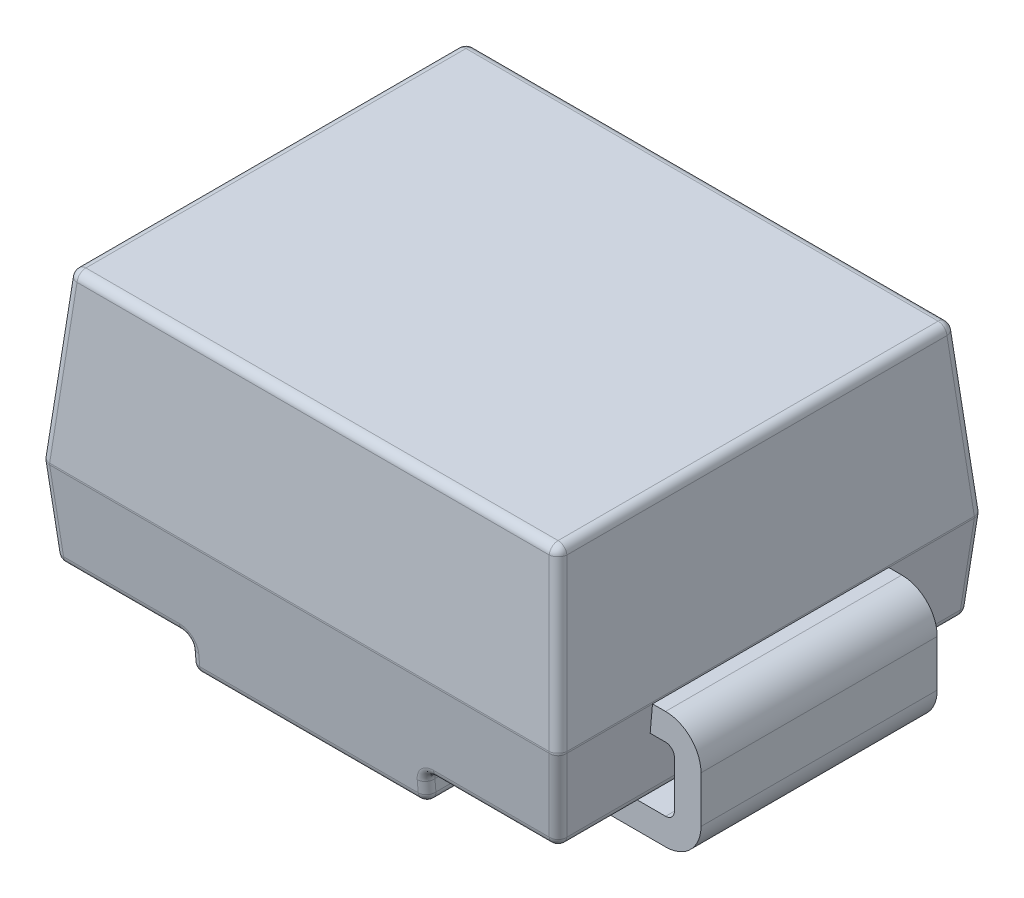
ISO-10303-21;
HEADER;
FILE_DESCRIPTION(('STEP AP214'),'2;1');
FILE_NAME('part.step','',(''),(''),'','','');
FILE_SCHEMA(('AUTOMOTIVE_DESIGN { 1 0 10303 214 1 1 1 1 }'));
ENDSEC;
DATA;
#1=APPLICATION_CONTEXT('core data for automotive mechanical design processes');
#2=APPLICATION_PROTOCOL_DEFINITION('international standard','automotive_design',2000,#1);
#3=PRODUCT_CONTEXT('',#1,'mechanical');
#4=PRODUCT('Part','Part','',(#3));
#5=PRODUCT_RELATED_PRODUCT_CATEGORY('part','',(#4));
#6=PRODUCT_DEFINITION_FORMATION('','',#4);
#7=PRODUCT_DEFINITION_CONTEXT('part definition',#1,'design');
#8=PRODUCT_DEFINITION('design','',#6,#7);
#9=PRODUCT_DEFINITION_SHAPE('','',#8);
#10=(LENGTH_UNIT() NAMED_UNIT(*) SI_UNIT(.MILLI.,.METRE.));
#11=(NAMED_UNIT(*) PLANE_ANGLE_UNIT() SI_UNIT($,.RADIAN.));
#12=(NAMED_UNIT(*) SI_UNIT($,.STERADIAN.) SOLID_ANGLE_UNIT());
#13=UNCERTAINTY_MEASURE_WITH_UNIT(LENGTH_MEASURE(1.E-05),#10,'distance_accuracy_value','');
#14=(GEOMETRIC_REPRESENTATION_CONTEXT(3) GLOBAL_UNCERTAINTY_ASSIGNED_CONTEXT((#13)) GLOBAL_UNIT_ASSIGNED_CONTEXT((#10,
#11,#12)) REPRESENTATION_CONTEXT('',''));
#15=CARTESIAN_POINT('',(0.,0.,0.));
#16=DIRECTION('',(0.,0.,1.));
#17=DIRECTION('',(1.,0.,0.));
#18=AXIS2_PLACEMENT_3D('',#15,#16,#17);
#19=CARTESIAN_POINT('',(-1.998791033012,2.325,1.608791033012));
#20=DIRECTION('',(-0.855296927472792,-0.419999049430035,-0.303427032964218));
#21=DIRECTION('',(-0.0105843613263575,0.599650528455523,-0.800191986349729));
#22=AXIS2_PLACEMENT_3D('',#19,#20,#21);
#23=SPHERICAL_SURFACE('',#22,0.075);
#24=CARTESIAN_POINT('',(-1.998791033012,2.325,1.608791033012));
#25=DIRECTION('',(0.,0.,-1.));
#26=DIRECTION('',(1.,0.,0.));
#27=AXIS2_PLACEMENT_3D('',#24,#25,#26);
#28=CIRCLE('',#27,0.075);
#29=CARTESIAN_POINT('',(-2.073505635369,2.331536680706,1.608791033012));
#30=VERTEX_POINT('',#29);
#31=CARTESIAN_POINT('',(-1.998791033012,2.4,1.608791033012));
#32=VERTEX_POINT('',#31);
#33=EDGE_CURVE('E412',#30,#32,#28,.T.);
#34=ORIENTED_EDGE('',*,*,#33,.F.);
#35=CARTESIAN_POINT('',(-1.998791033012,2.325,1.608791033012));
#36=DIRECTION('',(-0.0868265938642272,-0.992432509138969,0.0868265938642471));
#37=DIRECTION('',(-0.996194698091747,0.0871557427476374,0.));
#38=AXIS2_PLACEMENT_3D('',#35,#36,#37);
#39=CIRCLE('',#38,0.075);
#40=CARTESIAN_POINT('',(-1.998791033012,2.331536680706,1.683505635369));
#41=VERTEX_POINT('',#40);
#42=EDGE_CURVE('E856',#41,#30,#39,.T.);
#43=ORIENTED_EDGE('',*,*,#42,.F.);
#44=CARTESIAN_POINT('',(-1.998791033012,2.325,1.608791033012));
#45=DIRECTION('',(1.,0.,0.));
#46=DIRECTION('',(0.,-1.,0.));
#47=AXIS2_PLACEMENT_3D('',#44,#45,#46);
#48=CIRCLE('',#47,0.075);
#49=EDGE_CURVE('E11',#32,#41,#48,.T.);
#50=ORIENTED_EDGE('',*,*,#49,.F.);
#51=EDGE_LOOP('',(#34,#43,#50));
#52=FACE_BOUND('',#51,.T.);
#53=ADVANCED_FACE('F17',(#52),#23,.T.);
#54=CARTESIAN_POINT('',(0.,2.325,1.608791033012));
#55=DIRECTION('',(1.,0.,0.));
#56=DIRECTION('',(0.,-0.737277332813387,-0.675590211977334));
#57=AXIS2_PLACEMENT_3D('',#54,#55,#56);
#58=CYLINDRICAL_SURFACE('',#57,0.075);
#59=ORIENTED_EDGE('',*,*,#49,.T.);
#60=DIRECTION('',(-1.,0.,0.));
#61=VECTOR('',#60,1.);
#62=CARTESIAN_POINT('',(-2.067515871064,2.331536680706,1.683505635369));
#63=LINE('',#62,#61);
#64=CARTESIAN_POINT('',(1.998791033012,2.331536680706,1.683505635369));
#65=VERTEX_POINT('',#64);
#66=EDGE_CURVE('E848',#65,#41,#63,.T.);
#67=ORIENTED_EDGE('',*,*,#66,.F.);
#68=CARTESIAN_POINT('',(1.998791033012,2.325,1.608791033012));
#69=DIRECTION('',(1.,0.,0.));
#70=DIRECTION('',(0.,0.,-1.));
#71=AXIS2_PLACEMENT_3D('',#68,#69,#70);
#72=CIRCLE('',#71,0.075);
#73=CARTESIAN_POINT('',(1.998791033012,2.4,1.608791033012));
#74=VERTEX_POINT('',#73);
#75=EDGE_CURVE('E42',#74,#65,#72,.T.);
#76=ORIENTED_EDGE('',*,*,#75,.F.);
#77=DIRECTION('',(1.,0.,0.));
#78=VECTOR('',#77,1.);
#79=CARTESIAN_POINT('',(2.067515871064,2.4,1.608791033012));
#80=LINE('',#79,#78);
#81=EDGE_CURVE('E28',#32,#74,#80,.T.);
#82=ORIENTED_EDGE('',*,*,#81,.F.);
#83=EDGE_LOOP('',(#59,#67,#76,#82));
#84=FACE_BOUND('',#83,.T.);
#85=ADVANCED_FACE('F2943',(#84),#58,.T.);
#86=CARTESIAN_POINT('',(0.,2.4,0.));
#87=DIRECTION('',(0.,1.,0.));
#88=DIRECTION('',(1.,0.,0.));
#89=AXIS2_PLACEMENT_3D('',#86,#87,#88);
#90=PLANE('',#89);
#91=DIRECTION('',(0.,0.,-1.));
#92=VECTOR('',#91,1.);
#93=CARTESIAN_POINT('',(1.998791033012,2.4,-1.677515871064));
#94=LINE('',#93,#92);
#95=CARTESIAN_POINT('',(1.998791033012,2.4,-1.608791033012));
#96=VERTEX_POINT('',#95);
#97=EDGE_CURVE('E423',#74,#96,#94,.T.);
#98=ORIENTED_EDGE('',*,*,#97,.T.);
#99=DIRECTION('',(-1.,0.,0.));
#100=VECTOR('',#99,1.);
#101=CARTESIAN_POINT('',(-2.067515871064,2.4,-1.608791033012));
#102=LINE('',#101,#100);
#103=CARTESIAN_POINT('',(-1.998791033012,2.4,-1.608791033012));
#104=VERTEX_POINT('',#103);
#105=EDGE_CURVE('E370',#96,#104,#102,.T.);
#106=ORIENTED_EDGE('',*,*,#105,.T.);
#107=DIRECTION('',(0.,0.,1.));
#108=VECTOR('',#107,1.);
#109=CARTESIAN_POINT('',(-1.998791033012,2.4,1.677515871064));
#110=LINE('',#109,#108);
#111=EDGE_CURVE('E413',#104,#32,#110,.T.);
#112=ORIENTED_EDGE('',*,*,#111,.T.);
#113=ORIENTED_EDGE('',*,*,#81,.T.);
#114=EDGE_LOOP('',(#98,#106,#112,#113));
#115=FACE_BOUND('',#114,.T.);
#116=ADVANCED_FACE('F2934',(#115),#90,.T.);
#117=CARTESIAN_POINT('',(1.998791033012,2.325,0.));
#118=DIRECTION('',(0.,0.,-1.));
#119=DIRECTION('',(-0.675590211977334,-0.737277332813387,0.));
#120=AXIS2_PLACEMENT_3D('',#117,#118,#119);
#121=CYLINDRICAL_SURFACE('',#120,0.075);
#122=CARTESIAN_POINT('',(1.998791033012,2.325,1.608791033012));
#123=DIRECTION('',(0.,0.,-1.));
#124=DIRECTION('',(0.,-1.,0.));
#125=AXIS2_PLACEMENT_3D('',#122,#123,#124);
#126=CIRCLE('',#125,0.075);
#127=CARTESIAN_POINT('',(2.073505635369,2.331536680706,1.608791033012));
#128=VERTEX_POINT('',#127);
#129=EDGE_CURVE('E419',#74,#128,#126,.T.);
#130=ORIENTED_EDGE('',*,*,#129,.T.);
#131=DIRECTION('',(0.,0.,1.));
#132=VECTOR('',#131,1.);
#133=CARTESIAN_POINT('',(2.073505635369,2.331536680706,1.677515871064));
#134=LINE('',#133,#132);
#135=CARTESIAN_POINT('',(2.073505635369,2.331536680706,-1.608791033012));
#136=VERTEX_POINT('',#135);
#137=EDGE_CURVE('E824',#136,#128,#134,.T.);
#138=ORIENTED_EDGE('',*,*,#137,.F.);
#139=CARTESIAN_POINT('',(1.998791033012,2.325,-1.608791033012));
#140=DIRECTION('',(0.,0.,-1.));
#141=DIRECTION('',(-1.,0.,0.));
#142=AXIS2_PLACEMENT_3D('',#139,#140,#141);
#143=CIRCLE('',#142,0.075);
#144=EDGE_CURVE('E354',#96,#136,#143,.T.);
#145=ORIENTED_EDGE('',*,*,#144,.F.);
#146=ORIENTED_EDGE('',*,*,#97,.F.);
#147=EDGE_LOOP('',(#130,#138,#145,#146));
#148=FACE_BOUND('',#147,.T.);
#149=ADVANCED_FACE('F562',(#148),#121,.T.);
#150=CARTESIAN_POINT('',(0.,2.325,-1.608791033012));
#151=DIRECTION('',(-1.,0.,0.));
#152=DIRECTION('',(0.,-0.737277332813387,0.675590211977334));
#153=AXIS2_PLACEMENT_3D('',#150,#151,#152);
#154=CYLINDRICAL_SURFACE('',#153,0.075);
#155=CARTESIAN_POINT('',(-1.998791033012,2.325,-1.608791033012));
#156=DIRECTION('',(1.,0.,0.));
#157=DIRECTION('',(0.,0.,1.));
#158=AXIS2_PLACEMENT_3D('',#155,#156,#157);
#159=CIRCLE('',#158,0.075);
#160=CARTESIAN_POINT('',(-1.998791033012,2.331536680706,-1.683505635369));
#161=VERTEX_POINT('',#160);
#162=EDGE_CURVE('E1268',#161,#104,#159,.T.);
#163=ORIENTED_EDGE('',*,*,#162,.T.);
#164=ORIENTED_EDGE('',*,*,#105,.F.);
#165=CARTESIAN_POINT('',(1.998791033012,2.325,-1.608791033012));
#166=DIRECTION('',(1.,0.,0.));
#167=DIRECTION('',(0.,0.,-1.));
#168=AXIS2_PLACEMENT_3D('',#165,#166,#167);
#169=CIRCLE('',#168,0.075);
#170=CARTESIAN_POINT('',(1.998791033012,2.331536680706,-1.683505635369));
#171=VERTEX_POINT('',#170);
#172=EDGE_CURVE('E351',#171,#96,#169,.T.);
#173=ORIENTED_EDGE('',*,*,#172,.F.);
#174=DIRECTION('',(1.,0.,0.));
#175=VECTOR('',#174,1.);
#176=CARTESIAN_POINT('',(2.067515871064,2.331536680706,-1.683505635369));
#177=LINE('',#176,#175);
#178=EDGE_CURVE('E367',#161,#171,#177,.T.);
#179=ORIENTED_EDGE('',*,*,#178,.F.);
#180=EDGE_LOOP('',(#163,#164,#173,#179));
#181=FACE_BOUND('',#180,.T.);
#182=ADVANCED_FACE('F365',(#181),#154,.T.);
#183=CARTESIAN_POINT('',(-1.998791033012,2.325,0.));
#184=DIRECTION('',(0.,0.,1.));
#185=DIRECTION('',(0.675590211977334,-0.737277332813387,0.));
#186=AXIS2_PLACEMENT_3D('',#183,#184,#185);
#187=CYLINDRICAL_SURFACE('',#186,0.075);
#188=ORIENTED_EDGE('',*,*,#33,.T.);
#189=ORIENTED_EDGE('',*,*,#111,.F.);
#190=CARTESIAN_POINT('',(-1.998791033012,2.325,-1.608791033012));
#191=DIRECTION('',(0.,0.,-1.));
#192=DIRECTION('',(0.,1.,0.));
#193=AXIS2_PLACEMENT_3D('',#190,#191,#192);
#194=CIRCLE('',#193,0.075);
#195=CARTESIAN_POINT('',(-2.073505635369,2.331536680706,-1.608791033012));
#196=VERTEX_POINT('',#195);
#197=EDGE_CURVE('E1272',#196,#104,#194,.T.);
#198=ORIENTED_EDGE('',*,*,#197,.F.);
#199=DIRECTION('',(0.,0.,-1.));
#200=VECTOR('',#199,1.);
#201=CARTESIAN_POINT('',(-2.073505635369,2.331536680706,-1.677515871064));
#202=LINE('',#201,#200);
#203=EDGE_CURVE('E408',#30,#196,#202,.T.);
#204=ORIENTED_EDGE('',*,*,#203,.F.);
#205=EDGE_LOOP('',(#188,#189,#198,#204));
#206=FACE_BOUND('',#205,.T.);
#207=ADVANCED_FACE('F561',(#206),#187,.T.);
#208=CARTESIAN_POINT('',(-2.19,1.,1.8));
#209=DIRECTION('',(-0.996194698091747,0.0871557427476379,0.));
#210=DIRECTION('',(0.,0.,1.));
#211=AXIS2_PLACEMENT_3D('',#208,#209,#210);
#212=PLANE('',#211);
#213=ORIENTED_EDGE('',*,*,#203,.T.);
#214=DIRECTION('',(-0.0868265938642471,-0.992432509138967,-0.0868265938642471));
#215=VECTOR('',#214,1.);
#216=CARTESIAN_POINT('',(-2.163423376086,1.303772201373,-1.698708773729));
#217=LINE('',#216,#215);
#218=CARTESIAN_POINT('',(-2.189428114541,1.006536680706,-1.724713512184));
#219=VERTEX_POINT('',#218);
#220=EDGE_CURVE('E404',#196,#219,#217,.T.);
#221=ORIENTED_EDGE('',*,*,#220,.T.);
#222=DIRECTION('',(0.,0.,1.));
#223=VECTOR('',#222,1.);
#224=CARTESIAN_POINT('',(-2.189428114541,1.006536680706,1.8));
#225=LINE('',#224,#223);
#226=CARTESIAN_POINT('',(-2.189428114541,1.006536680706,1.724713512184));
#227=VERTEX_POINT('',#226);
#228=EDGE_CURVE('E867',#219,#227,#225,.T.);
#229=ORIENTED_EDGE('',*,*,#228,.T.);
#230=DIRECTION('',(0.0868265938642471,0.992432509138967,-0.0868265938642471));
#231=VECTOR('',#230,1.);
#232=CARTESIAN_POINT('',(-2.190563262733,0.993561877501,1.725848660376));
#233=LINE('',#232,#231);
#234=EDGE_CURVE('E870',#227,#30,#233,.T.);
#235=ORIENTED_EDGE('',*,*,#234,.T.);
#236=EDGE_LOOP('',(#213,#221,#229,#235));
#237=FACE_BOUND('',#236,.T.);
#238=ADVANCED_FACE('F1309',(#237),#212,.T.);
#239=CARTESIAN_POINT('',(-2.088708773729,1.297235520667,-1.698708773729));
#240=DIRECTION('',(-0.0868265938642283,-0.992432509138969,-0.0868265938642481));
#241=DIRECTION('',(0.701755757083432,-0.122791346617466,0.701755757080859));
#242=AXIS2_PLACEMENT_3D('',#239,#240,#241);
#243=CYLINDRICAL_SURFACE('',#242,0.075);
#244=ORIENTED_EDGE('',*,*,#220,.F.);
#245=CARTESIAN_POINT('',(-1.998791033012,2.325,-1.608791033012));
#246=DIRECTION('',(-0.0868265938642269,-0.992432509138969,-0.0868265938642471));
#247=DIRECTION('',(-0.996194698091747,0.0871557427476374,0.));
#248=AXIS2_PLACEMENT_3D('',#245,#246,#247);
#249=CIRCLE('',#248,0.075);
#250=EDGE_CURVE('E1276',#196,#161,#249,.T.);
#251=ORIENTED_EDGE('',*,*,#250,.T.);
#252=DIRECTION('',(0.0868265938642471,0.992432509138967,0.0868265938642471));
#253=VECTOR('',#252,1.);
#254=CARTESIAN_POINT('',(-2.082828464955,1.370984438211,-1.767543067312));
#255=LINE('',#254,#253);
#256=CARTESIAN_POINT('',(-2.114713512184,1.006536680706,-1.799428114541));
#257=VERTEX_POINT('',#256);
#258=EDGE_CURVE('E382',#257,#161,#255,.T.);
#259=ORIENTED_EDGE('',*,*,#258,.F.);
#260=CARTESIAN_POINT('',(-2.114713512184,1.,-1.724713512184));
#261=DIRECTION('',(-0.0868265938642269,-0.992432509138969,-0.0868265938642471));
#262=DIRECTION('',(0.996194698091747,-0.0871557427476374,0.));
#263=AXIS2_PLACEMENT_3D('',#260,#261,#262);
#264=CIRCLE('',#263,0.075);
#265=EDGE_CURVE('E1155',#219,#257,#264,.T.);
#266=ORIENTED_EDGE('',*,*,#265,.F.);
#267=EDGE_LOOP('',(#244,#251,#259,#266));
#268=FACE_BOUND('',#267,.T.);
#269=ADVANCED_FACE('F1312',(#268),#243,.T.);
#270=CARTESIAN_POINT('',(2.19,1.,-1.8));
#271=DIRECTION('',(0.,0.0871557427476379,-0.996194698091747));
#272=DIRECTION('',(-1.,0.,0.));
#273=AXIS2_PLACEMENT_3D('',#270,#271,#272);
#274=PLANE('',#273);
#275=ORIENTED_EDGE('',*,*,#178,.T.);
#276=DIRECTION('',(0.0868265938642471,-0.992432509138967,-0.0868265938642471));
#277=VECTOR('',#276,1.);
#278=CARTESIAN_POINT('',(2.115848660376,0.993561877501,-1.800563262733));
#279=LINE('',#278,#277);
#280=CARTESIAN_POINT('',(2.114713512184,1.006536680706,-1.799428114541));
#281=VERTEX_POINT('',#280);
#282=EDGE_CURVE('E379',#171,#281,#279,.T.);
#283=ORIENTED_EDGE('',*,*,#282,.T.);
#284=DIRECTION('',(-1.,0.,0.));
#285=VECTOR('',#284,1.);
#286=CARTESIAN_POINT('',(-2.19,1.006536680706,-1.799428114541));
#287=LINE('',#286,#285);
#288=EDGE_CURVE('E390',#281,#257,#287,.T.);
#289=ORIENTED_EDGE('',*,*,#288,.T.);
#290=ORIENTED_EDGE('',*,*,#258,.T.);
#291=EDGE_LOOP('',(#275,#283,#289,#290));
#292=FACE_BOUND('',#291,.T.);
#293=ADVANCED_FACE('F377',(#292),#274,.T.);
#294=CARTESIAN_POINT('',(2.115848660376,0.987025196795,-1.725848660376));
#295=DIRECTION('',(0.0868265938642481,-0.992432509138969,-0.0868265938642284));
#296=DIRECTION('',(-0.701755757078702,-0.122791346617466,0.701755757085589));
#297=AXIS2_PLACEMENT_3D('',#294,#295,#296);
#298=CYLINDRICAL_SURFACE('',#297,0.075);
#299=ORIENTED_EDGE('',*,*,#282,.F.);
#300=CARTESIAN_POINT('',(1.998791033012,2.325,-1.608791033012));
#301=DIRECTION('',(0.0868265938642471,-0.992432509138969,-0.0868265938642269));
#302=DIRECTION('',(0.,-0.0871557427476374,0.996194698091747));
#303=AXIS2_PLACEMENT_3D('',#300,#301,#302);
#304=CIRCLE('',#303,0.075);
#305=EDGE_CURVE('E347',#171,#136,#304,.T.);
#306=ORIENTED_EDGE('',*,*,#305,.T.);
#307=DIRECTION('',(-0.0868265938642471,0.992432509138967,0.0868265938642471));
#308=VECTOR('',#307,1.);
#309=CARTESIAN_POINT('',(2.163423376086,1.303772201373,-1.698708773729));
#310=LINE('',#309,#308);
#311=CARTESIAN_POINT('',(2.189428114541,1.006536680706,-1.724713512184));
#312=VERTEX_POINT('',#311);
#313=EDGE_CURVE('E820',#312,#136,#310,.T.);
#314=ORIENTED_EDGE('',*,*,#313,.F.);
#315=CARTESIAN_POINT('',(2.114713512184,1.,-1.724713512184));
#316=DIRECTION('',(0.0868265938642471,-0.992432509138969,-0.0868265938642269));
#317=DIRECTION('',(0.,0.0871557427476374,-0.996194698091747));
#318=AXIS2_PLACEMENT_3D('',#315,#316,#317);
#319=CIRCLE('',#318,0.075);
#320=EDGE_CURVE('E387',#281,#312,#319,.T.);
#321=ORIENTED_EDGE('',*,*,#320,.F.);
#322=EDGE_LOOP('',(#299,#306,#314,#321));
#323=FACE_BOUND('',#322,.T.);
#324=ADVANCED_FACE('F385',(#323),#298,.T.);
#325=CARTESIAN_POINT('',(2.19,1.,-1.724713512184));
#326=DIRECTION('',(-1.,0.,0.));
#327=DIRECTION('',(0.,0.,1.));
#328=AXIS2_PLACEMENT_3D('',#325,#326,#327);
#329=CYLINDRICAL_SURFACE('',#328,0.075);
#330=CARTESIAN_POINT('',(-2.114713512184,1.,-1.724713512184));
#331=DIRECTION('',(1.,0.,0.));
#332=DIRECTION('',(0.,0.,1.));
#333=AXIS2_PLACEMENT_3D('',#330,#331,#332);
#334=CIRCLE('',#333,0.075);
#335=CARTESIAN_POINT('',(-2.114713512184,0.993463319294,-1.799428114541));
#336=VERTEX_POINT('',#335);
#337=EDGE_CURVE('E1150',#336,#257,#334,.T.);
#338=ORIENTED_EDGE('',*,*,#337,.T.);
#339=ORIENTED_EDGE('',*,*,#288,.F.);
#340=CARTESIAN_POINT('',(2.114713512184,1.,-1.724713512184));
#341=DIRECTION('',(1.,0.,0.));
#342=DIRECTION('',(0.,1.,0.));
#343=AXIS2_PLACEMENT_3D('',#340,#341,#342);
#344=CIRCLE('',#343,0.075);
#345=CARTESIAN_POINT('',(2.114713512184,0.993463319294,-1.799428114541));
#346=VERTEX_POINT('',#345);
#347=EDGE_CURVE('E1105',#346,#281,#344,.T.);
#348=ORIENTED_EDGE('',*,*,#347,.F.);
#349=DIRECTION('',(1.,0.,0.));
#350=VECTOR('',#349,1.);
#351=CARTESIAN_POINT('',(2.19,0.993463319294,-1.799428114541));
#352=LINE('',#351,#350);
#353=EDGE_CURVE('E687',#336,#346,#352,.T.);
#354=ORIENTED_EDGE('',*,*,#353,.F.);
#355=EDGE_LOOP('',(#338,#339,#348,#354));
#356=FACE_BOUND('',#355,.T.);
#357=ADVANCED_FACE('F2889',(#356),#329,.T.);
#358=CARTESIAN_POINT('',(-0.925,0.075,1.643786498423));
#359=DIRECTION('',(-0.843069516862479,0.511967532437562,-0.164690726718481));
#360=DIRECTION('',(-0.154199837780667,-0.523483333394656,-0.837966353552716));
#361=AXIS2_PLACEMENT_3D('',#358,#359,#360);
#362=SPHERICAL_SURFACE('',#361,0.075);
#363=CARTESIAN_POINT('',(-0.925,0.075,1.643786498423));
#364=DIRECTION('',(0.,0.,-1.));
#365=DIRECTION('',(1.,0.,0.));
#366=AXIS2_PLACEMENT_3D('',#363,#364,#365);
#367=CIRCLE('',#366,0.075);
#368=CARTESIAN_POINT('',(-0.925,0.,1.643786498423));
#369=VERTEX_POINT('',#368);
#370=CARTESIAN_POINT('',(-1.,0.075,1.643786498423));
#371=VERTEX_POINT('',#370);
#372=EDGE_CURVE('E1071',#369,#371,#367,.T.);
#373=ORIENTED_EDGE('',*,*,#372,.F.);
#374=CARTESIAN_POINT('',(-0.925,0.075,1.643786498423));
#375=DIRECTION('',(1.,0.,0.));
#376=DIRECTION('',(0.,0.,1.));
#377=AXIS2_PLACEMENT_3D('',#374,#375,#376);
#378=CIRCLE('',#377,0.075);
#379=CARTESIAN_POINT('',(-0.925,0.06846331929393,1.71850110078));
#380=VERTEX_POINT('',#379);
#381=EDGE_CURVE('E1057',#380,#369,#378,.T.);
#382=ORIENTED_EDGE('',*,*,#381,.F.);
#383=CARTESIAN_POINT('',(-0.925,0.075,1.643786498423));
#384=DIRECTION('',(0.,-0.996194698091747,-0.087155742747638));
#385=DIRECTION('',(0.,0.087155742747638,-0.996194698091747));
#386=AXIS2_PLACEMENT_3D('',#383,#384,#385);
#387=CIRCLE('',#386,0.075);
#388=EDGE_CURVE('E396',#380,#371,#387,.T.);
#389=ORIENTED_EDGE('',*,*,#388,.T.);
#390=EDGE_LOOP('',(#373,#382,#389));
#391=FACE_BOUND('',#390,.T.);
#392=ADVANCED_FACE('F2659',(#391),#362,.T.);
#393=CARTESIAN_POINT('',(-0.925,-0.346548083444,1.60690581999));
#394=DIRECTION('',(0.,-0.996194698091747,-0.087155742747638));
#395=DIRECTION('',(0.707106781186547,0.0616284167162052,-0.70441602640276));
#396=AXIS2_PLACEMENT_3D('',#393,#394,#395);
#397=CYLINDRICAL_SURFACE('',#396,0.075);
#398=CARTESIAN_POINT('',(-0.925,0.176517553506,1.652668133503));
#399=DIRECTION('',(0.,-0.996194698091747,-0.0871557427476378));
#400=DIRECTION('',(0.,-0.0871557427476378,0.996194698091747));
#401=AXIS2_PLACEMENT_3D('',#398,#399,#400);
#402=CIRCLE('',#401,0.075);
#403=CARTESIAN_POINT('',(-0.925,0.1699808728,1.72738273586));
#404=VERTEX_POINT('',#403);
#405=CARTESIAN_POINT('',(-1.,0.176517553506,1.652668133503));
#406=VERTEX_POINT('',#405);
#407=EDGE_CURVE('E1052',#404,#406,#402,.T.);
#408=ORIENTED_EDGE('',*,*,#407,.T.);
#409=DIRECTION('',(0.,0.996194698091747,0.0871557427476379));
#410=VECTOR('',#409,1.);
#411=CARTESIAN_POINT('',(-1.,0.258054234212,1.659801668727));
#412=LINE('',#411,#410);
#413=EDGE_CURVE('E2070',#371,#406,#412,.T.);
#414=ORIENTED_EDGE('',*,*,#413,.F.);
#415=ORIENTED_EDGE('',*,*,#388,.F.);
#416=DIRECTION('',(0.,-0.996194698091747,-0.0871557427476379));
#417=VECTOR('',#416,1.);
#418=CARTESIAN_POINT('',(-0.925,0.,1.712511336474));
#419=LINE('',#418,#417);
#420=EDGE_CURVE('E636',#404,#380,#419,.T.);
#421=ORIENTED_EDGE('',*,*,#420,.F.);
#422=EDGE_LOOP('',(#408,#414,#415,#421));
#423=FACE_BOUND('',#422,.T.);
#424=ADVANCED_FACE('F2655',(#423),#397,.T.);
#425=CARTESIAN_POINT('',(-0.92479070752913,0.1699808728,1.72738273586));
#426=CARTESIAN_POINT('',(-0.924895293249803,0.1699808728,1.72738273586));
#427=CARTESIAN_POINT('',(-0.925002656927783,0.1699808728,1.72738273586));
#428=CARTESIAN_POINT('',(-1.,0.169981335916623,1.72737744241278));
#429=CARTESIAN_POINT('',(-1.,0.176517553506,1.652668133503));
#430=CARTESIAN_POINT('',(-0.92479579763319,0.251805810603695,1.73454149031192));
#431=CARTESIAN_POINT('',(-0.924897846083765,0.25174683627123,1.73453633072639));
#432=CARTESIAN_POINT('',(-0.925002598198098,0.251686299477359,1.7345310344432));
#433=CARTESIAN_POINT('',(-0.996507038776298,0.210364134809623,1.73091084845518));
#434=CARTESIAN_POINT('',(-1.,0.217371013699,1.659816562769));
#435=CARTESIAN_POINT('',(-0.993186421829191,0.320180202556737,1.74052347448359));
#436=CARTESIAN_POINT('',(-0.993239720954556,0.32008058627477,1.74051475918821));
#437=CARTESIAN_POINT('',(-0.993294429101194,0.319978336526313,1.74050581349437));
#438=CARTESIAN_POINT('',(-1.02992427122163,0.251517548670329,1.73451160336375));
#439=CARTESIAN_POINT('',(-1.034146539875,0.251517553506,1.665791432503));
#440=CARTESIAN_POINT('',(-1.075,0.320180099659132,1.74052346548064));
#441=CARTESIAN_POINT('',(-1.075,0.320080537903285,1.74051475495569));
#442=CARTESIAN_POINT('',(-1.075,0.319978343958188,1.74050581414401));
#443=CARTESIAN_POINT('',(-1.075,0.251517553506,1.73451160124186));
#444=CARTESIAN_POINT('',(-1.075,0.251517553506,1.665791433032));
#445=(BOUNDED_SURFACE() B_SPLINE_SURFACE(3,2,((#425,#426,#427,#428,#429),(#430,#431,#432,#433,
#434),(#435,#436,#437,#438,#439),(#440,#441,#442,#443,#444)),.UNSPECIFIED.,.F.,.F.,
.F.) B_SPLINE_SURFACE_WITH_KNOTS((4,4),(3,1,1,3),(1.570796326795,3.14159265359),
(-0.00197551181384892,0.,5.00987755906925E-05,1.),
.UNSPECIFIED.) GEOMETRIC_REPRESENTATION_ITEM() RATIONAL_B_SPLINE_SURFACE(((1.00115722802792,
1.00057861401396,0.999985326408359,0.707121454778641,1.),(1.00109211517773,1.00054605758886,
0.999986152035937,0.723600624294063,1.),(1.00103643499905,1.00051821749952,0.999986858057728,
0.737692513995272,1.),(1.00103802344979,1.0005190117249,0.999986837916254,0.737290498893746,1.))) REPRESENTATION_ITEM('') SURFACE());
#446=CARTESIAN_POINT('',(-0.925,0.1699808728,1.72738273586));
#447=CARTESIAN_POINT('',(-0.925,0.205336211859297,1.73047592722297));
#448=CARTESIAN_POINT('',(-0.940174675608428,0.246438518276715,1.73407191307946));
#449=CARTESIAN_POINT('',(-0.998443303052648,0.304916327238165,1.73918805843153));
#450=CARTESIAN_POINT('',(-1.0396446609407,0.3199808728,1.74050603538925));
#451=CARTESIAN_POINT('',(-1.075,0.3199808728,1.740506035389));
#452=B_SPLINE_CURVE_WITH_KNOTS('',3,(#446,#447,#448,#449,#450,#451),.UNSPECIFIED.,.F.,.F.,(4,2,
4),(0.,0.5,1.),.UNSPECIFIED.);
#453=CARTESIAN_POINT('',(-1.075,0.3199808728,1.740506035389));
#454=VERTEX_POINT('',#453);
#455=EDGE_CURVE('E629',#404,#454,#452,.T.);
#456=CARTESIAN_POINT('',(-1.075,0.326517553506,1.665791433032));
#457=DIRECTION('',(1.,0.,0.));
#458=DIRECTION('',(0.,0.,-1.));
#459=AXIS2_PLACEMENT_3D('',#456,#457,#458);
#460=CIRCLE('',#459,0.075);
#461=CARTESIAN_POINT('',(-1.075,0.251517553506,1.665791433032));
#462=VERTEX_POINT('',#461);
#463=EDGE_CURVE('E1021',#454,#462,#460,.T.);
#464=CARTESIAN_POINT('',(-1.075,0.251517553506,1.665791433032));
#465=CARTESIAN_POINT('',(-1.034146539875,0.251517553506,1.665791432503));
#466=CARTESIAN_POINT('',(-1.,0.217371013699,1.659816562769));
#467=CARTESIAN_POINT('',(-1.,0.176517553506,1.652668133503));
#468=(BOUNDED_CURVE() B_SPLINE_CURVE(3,(#464,#465,#466,#467),.UNSPECIFIED.,.F.,
.F.) B_SPLINE_CURVE_WITH_KNOTS((4,4),(1.570796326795,3.14159265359),
.UNSPECIFIED.) CURVE() GEOMETRIC_REPRESENTATION_ITEM() RATIONAL_B_SPLINE_CURVE((1.,1.,1.,1.)) REPRESENTATION_ITEM(''));
#469=EDGE_CURVE('E2069',#406,#462,#468,.F.);
#470=ORIENTED_EDGE('',*,*,#455,.T.);
#471=ORIENTED_EDGE('',*,*,#463,.T.);
#472=ORIENTED_EDGE('',*,*,#469,.F.);
#473=ORIENTED_EDGE('',*,*,#407,.F.);
#474=EDGE_LOOP('',(#470,#471,#472,#473));
#475=FACE_BOUND('',#474,.T.);
#476=ADVANCED_FACE('F453',(#475),#445,.T.);
#477=CARTESIAN_POINT('',(-1.075,0.320181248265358,-1.74052356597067));
#478=CARTESIAN_POINT('',(-1.075,0.320081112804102,-1.74051480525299));
#479=CARTESIAN_POINT('',(-1.075,0.319978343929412,-1.74050581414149));
#480=CARTESIAN_POINT('',(-1.075,0.251517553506,-1.73451160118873));
#481=CARTESIAN_POINT('',(-1.075,0.251517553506,-1.665791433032));
#482=CARTESIAN_POINT('',(-0.993185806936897,0.320181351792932,-1.74052357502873));
#483=CARTESIAN_POINT('',(-0.993239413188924,0.320081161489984,-1.74051480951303));
#484=CARTESIAN_POINT('',(-0.993294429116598,0.319978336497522,-1.74050581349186));
#485=CARTESIAN_POINT('',(-1.02992427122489,0.251517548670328,-1.73451160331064));
#486=CARTESIAN_POINT('',(-1.034146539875,0.251517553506,-1.665791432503));
#487=CARTESIAN_POINT('',(-0.924794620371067,0.251806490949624,-1.73454154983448));
#488=CARTESIAN_POINT('',(-0.924897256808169,0.251747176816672,-1.73453636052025));
#489=CARTESIAN_POINT('',(-0.925002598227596,0.251686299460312,-1.73453103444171));
#490=CARTESIAN_POINT('',(-0.99650703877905,0.210364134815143,-1.73091084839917));
#491=CARTESIAN_POINT('',(-1.,0.217371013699,-1.659816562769));
#492=CARTESIAN_POINT('',(-0.92478950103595,0.1699808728,-1.72738273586));
#493=CARTESIAN_POINT('',(-0.924894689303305,0.1699808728,-1.72738273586));
#494=CARTESIAN_POINT('',(-0.925002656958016,0.1699808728,-1.72738273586));
#495=CARTESIAN_POINT('',(-1.,0.169981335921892,-1.72737744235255));
#496=CARTESIAN_POINT('',(-1.,0.176517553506,-1.652668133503));
#497=(BOUNDED_SURFACE() B_SPLINE_SURFACE(3,2,((#477,#478,#479,#480,#481),(#482,#483,#484,#485,
#486),(#487,#488,#489,#490,#491),(#492,#493,#494,#495,#496)),.UNSPECIFIED.,.F.,.F.,
.F.) B_SPLINE_SURFACE_WITH_KNOTS((4,4),(3,1,1,3),(0.,1.570796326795),(-0.00198691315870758,0.,
5.00993456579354E-05,1.),
.UNSPECIFIED.) GEOMETRIC_REPRESENTATION_ITEM() RATIONAL_B_SPLINE_SURFACE(((1.00104401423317,
1.00052200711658,0.999986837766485,0.737290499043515,1.),(1.00104241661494,1.00052120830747,
0.999986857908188,0.737692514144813,1.),(1.0010984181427,1.00054920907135,0.999986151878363,
0.723600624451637,1.),(1.00116390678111,1.00058195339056,0.99998532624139,0.70712145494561,1.))) REPRESENTATION_ITEM('') SURFACE());
#498=CARTESIAN_POINT('',(-1.075,0.326517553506,-1.665791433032));
#499=DIRECTION('',(1.,0.,0.));
#500=DIRECTION('',(0.,0.,-1.));
#501=AXIS2_PLACEMENT_3D('',#498,#499,#500);
#502=CIRCLE('',#501,0.075);
#503=CARTESIAN_POINT('',(-1.075,0.251517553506,-1.665791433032));
#504=VERTEX_POINT('',#503);
#505=CARTESIAN_POINT('',(-1.075,0.3199808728,-1.740506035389));
#506=VERTEX_POINT('',#505);
#507=EDGE_CURVE('E1282',#504,#506,#502,.T.);
#508=CARTESIAN_POINT('',(-1.075,0.3199808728,-1.740506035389));
#509=CARTESIAN_POINT('',(-1.0396446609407,0.3199808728,-1.74050603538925));
#510=CARTESIAN_POINT('',(-0.998551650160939,0.304810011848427,-1.73917875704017));
#511=CARTESIAN_POINT('',(-0.940065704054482,0.246545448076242,-1.7340812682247));
#512=CARTESIAN_POINT('',(-0.925,0.205336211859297,-1.73047592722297));
#513=CARTESIAN_POINT('',(-0.925,0.1699808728,-1.72738273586));
#514=B_SPLINE_CURVE_WITH_KNOTS('',3,(#508,#509,#510,#511,#512,#513),.UNSPECIFIED.,.F.,.F.,(4,2,
4),(0.,0.5,1.),.UNSPECIFIED.);
#515=CARTESIAN_POINT('',(-0.925,0.1699808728,-1.72738273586));
#516=VERTEX_POINT('',#515);
#517=EDGE_CURVE('E638',#506,#516,#514,.T.);
#518=CARTESIAN_POINT('',(-0.925,0.176517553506,-1.652668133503));
#519=DIRECTION('',(0.,-0.996194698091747,0.0871557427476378));
#520=DIRECTION('',(0.,0.0871557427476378,0.996194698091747));
#521=AXIS2_PLACEMENT_3D('',#518,#519,#520);
#522=CIRCLE('',#521,0.075);
#523=CARTESIAN_POINT('',(-1.,0.176517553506,-1.652668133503));
#524=VERTEX_POINT('',#523);
#525=EDGE_CURVE('E1084',#524,#516,#522,.T.);
#526=CARTESIAN_POINT('',(-1.,0.176517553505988,-1.65266813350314));
#527=CARTESIAN_POINT('',(-0.999999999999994,0.217371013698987,-1.65981656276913));
#528=CARTESIAN_POINT('',(-1.03414653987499,0.251517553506,-1.66579143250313));
#529=CARTESIAN_POINT('',(-1.075,0.251517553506,-1.66579143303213));
#530=(BOUNDED_CURVE() B_SPLINE_CURVE(3,(#526,#527,#528,#529),.UNSPECIFIED.,.F.,
.F.) B_SPLINE_CURVE_WITH_KNOTS((4,4),(0.,1.570796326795),
.UNSPECIFIED.) CURVE() GEOMETRIC_REPRESENTATION_ITEM() RATIONAL_B_SPLINE_CURVE((0.99999999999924,
0.999999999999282,0.999999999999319,0.999999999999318)) REPRESENTATION_ITEM(''));
#531=EDGE_CURVE('E433',#524,#504,#530,.T.);
#532=ORIENTED_EDGE('',*,*,#507,.T.);
#533=ORIENTED_EDGE('',*,*,#517,.T.);
#534=ORIENTED_EDGE('',*,*,#525,.F.);
#535=ORIENTED_EDGE('',*,*,#531,.T.);
#536=EDGE_LOOP('',(#532,#533,#534,#535));
#537=FACE_BOUND('',#536,.T.);
#538=ADVANCED_FACE('F440',(#537),#497,.T.);
#539=CARTESIAN_POINT('',(-1.075,0.176517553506,-1.8));
#540=DIRECTION('',(0.,0.,-1.));
#541=DIRECTION('',(-0.707106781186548,-0.707106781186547,0.));
#542=AXIS2_PLACEMENT_3D('',#539,#540,#541);
#543=CYLINDRICAL_SURFACE('',#542,0.075);
#544=ORIENTED_EDGE('',*,*,#469,.T.);
#545=DIRECTION('',(0.,0.,1.));
#546=VECTOR('',#545,1.);
#547=CARTESIAN_POINT('',(-1.075,0.251517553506,1.734516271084));
#548=LINE('',#547,#546);
#549=EDGE_CURVE('E2114',#504,#462,#548,.T.);
#550=ORIENTED_EDGE('',*,*,#549,.F.);
#551=ORIENTED_EDGE('',*,*,#531,.F.);
#552=DIRECTION('',(0.,0.,-1.));
#553=VECTOR('',#552,1.);
#554=CARTESIAN_POINT('',(-1.,0.176517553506,-1.734516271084));
#555=LINE('',#554,#553);
#556=EDGE_CURVE('E2064',#406,#524,#555,.T.);
#557=ORIENTED_EDGE('',*,*,#556,.F.);
#558=EDGE_LOOP('',(#544,#550,#551,#557));
#559=FACE_BOUND('',#558,.T.);
#560=ADVANCED_FACE('F452',(#559),#543,.F.);
#561=CARTESIAN_POINT('',(-1.,-0.04848244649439,-1.8));
#562=DIRECTION('',(1.,0.,0.));
#563=DIRECTION('',(0.,1.,0.));
#564=AXIS2_PLACEMENT_3D('',#561,#562,#563);
#565=PLANE('',#564);
#566=DIRECTION('',(0.,-0.996194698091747,0.0871557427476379));
#567=VECTOR('',#566,1.);
#568=CARTESIAN_POINT('',(-1.,0.006536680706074,-1.637796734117));
#569=LINE('',#568,#567);
#570=CARTESIAN_POINT('',(-1.,0.075,-1.643786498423));
#571=VERTEX_POINT('',#570);
#572=EDGE_CURVE('E2200',#524,#571,#569,.T.);
#573=ORIENTED_EDGE('',*,*,#572,.T.);
#574=DIRECTION('',(0.,0.,1.));
#575=VECTOR('',#574,1.);
#576=CARTESIAN_POINT('',(-1.,0.075,-1.8));
#577=LINE('',#576,#575);
#578=EDGE_CURVE('E1072',#571,#371,#577,.T.);
#579=ORIENTED_EDGE('',*,*,#578,.T.);
#580=ORIENTED_EDGE('',*,*,#413,.T.);
#581=ORIENTED_EDGE('',*,*,#556,.T.);
#582=EDGE_LOOP('',(#573,#579,#580,#581));
#583=FACE_BOUND('',#582,.T.);
#584=ADVANCED_FACE('F555',(#583),#565,.F.);
#585=CARTESIAN_POINT('',(-0.925,-0.03398136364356,-1.634251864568));
#586=DIRECTION('',(0.,0.996194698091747,-0.0871557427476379));
#587=DIRECTION('',(0.70710678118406,0.0616284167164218,0.704416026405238));
#588=AXIS2_PLACEMENT_3D('',#585,#586,#587);
#589=CYLINDRICAL_SURFACE('',#588,0.075);
#590=ORIENTED_EDGE('',*,*,#525,.T.);
#591=DIRECTION('',(0.,0.996194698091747,-0.0871557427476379));
#592=VECTOR('',#591,1.);
#593=CARTESIAN_POINT('',(-0.925,0.251517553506,-1.734516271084));
#594=LINE('',#593,#592);
#595=CARTESIAN_POINT('',(-0.925,0.06846331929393,-1.71850110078));
#596=VERTEX_POINT('',#595);
#597=EDGE_CURVE('E647',#596,#516,#594,.T.);
#598=ORIENTED_EDGE('',*,*,#597,.F.);
#599=CARTESIAN_POINT('',(-0.925,0.075,-1.643786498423));
#600=DIRECTION('',(0.,-0.996194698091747,0.087155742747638));
#601=DIRECTION('',(0.,-0.087155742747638,-0.996194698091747));
#602=AXIS2_PLACEMENT_3D('',#599,#600,#601);
#603=CIRCLE('',#602,0.075);
#604=EDGE_CURVE('E1132',#571,#596,#603,.T.);
#605=ORIENTED_EDGE('',*,*,#604,.F.);
#606=ORIENTED_EDGE('',*,*,#572,.F.);
#607=EDGE_LOOP('',(#590,#598,#605,#606));
#608=FACE_BOUND('',#607,.T.);
#609=ADVANCED_FACE('F465',(#608),#589,.T.);
#610=CARTESIAN_POINT('',(0.925,0.075,0.));
#611=DIRECTION('',(0.,0.,1.));
#612=DIRECTION('',(-0.707106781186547,0.707106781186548,0.));
#613=AXIS2_PLACEMENT_3D('',#610,#611,#612);
#614=CYLINDRICAL_SURFACE('',#613,0.075);
#615=CARTESIAN_POINT('',(0.925,0.075,1.643786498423));
#616=DIRECTION('',(0.,0.,-1.));
#617=DIRECTION('',(1.,0.,0.));
#618=AXIS2_PLACEMENT_3D('',#615,#616,#617);
#619=CIRCLE('',#618,0.075);
#620=CARTESIAN_POINT('',(1.,0.075,1.643786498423));
#621=VERTEX_POINT('',#620);
#622=CARTESIAN_POINT('',(0.925,0.,1.643786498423));
#623=VERTEX_POINT('',#622);
#624=EDGE_CURVE('E1053',#621,#623,#619,.T.);
#625=ORIENTED_EDGE('',*,*,#624,.T.);
#626=DIRECTION('',(0.,0.,1.));
#627=VECTOR('',#626,1.);
#628=CARTESIAN_POINT('',(0.925,0.,0.));
#629=LINE('',#628,#627);
#630=CARTESIAN_POINT('',(0.925,0.,-1.643786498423));
#631=VERTEX_POINT('',#630);
#632=EDGE_CURVE('E1067',#631,#623,#629,.T.);
#633=ORIENTED_EDGE('',*,*,#632,.F.);
#634=CARTESIAN_POINT('',(0.925,0.075,-1.643786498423));
#635=DIRECTION('',(0.,0.,-1.));
#636=DIRECTION('',(0.,1.,0.));
#637=AXIS2_PLACEMENT_3D('',#634,#635,#636);
#638=CIRCLE('',#637,0.075);
#639=CARTESIAN_POINT('',(1.,0.075,-1.643786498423));
#640=VERTEX_POINT('',#639);
#641=EDGE_CURVE('E1115',#640,#631,#638,.T.);
#642=ORIENTED_EDGE('',*,*,#641,.F.);
#643=DIRECTION('',(0.,0.,-1.));
#644=VECTOR('',#643,1.);
#645=CARTESIAN_POINT('',(1.,0.075,-1.8));
#646=LINE('',#645,#644);
#647=EDGE_CURVE('E1203',#621,#640,#646,.T.);
#648=ORIENTED_EDGE('',*,*,#647,.F.);
#649=EDGE_LOOP('',(#625,#633,#642,#648));
#650=FACE_BOUND('',#649,.T.);
#651=ADVANCED_FACE('F456',(#650),#614,.T.);
#652=CARTESIAN_POINT('',(2.19,0.075,-1.643786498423));
#653=DIRECTION('',(1.,0.,0.));
#654=DIRECTION('',(0.,0.737277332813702,0.67559021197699));
#655=AXIS2_PLACEMENT_3D('',#652,#653,#654);
#656=CYLINDRICAL_SURFACE('',#655,0.075);
#657=CARTESIAN_POINT('',(-0.925,0.075,-1.643786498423));
#658=DIRECTION('',(1.,0.,0.));
#659=DIRECTION('',(0.,0.,1.));
#660=AXIS2_PLACEMENT_3D('',#657,#658,#659);
#661=CIRCLE('',#660,0.075);
#662=CARTESIAN_POINT('',(-0.925,0.,-1.643786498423));
#663=VERTEX_POINT('',#662);
#664=EDGE_CURVE('E1142',#663,#596,#661,.T.);
#665=ORIENTED_EDGE('',*,*,#664,.T.);
#666=DIRECTION('',(-1.,0.,0.));
#667=VECTOR('',#666,1.);
#668=CARTESIAN_POINT('',(-1.,0.06846331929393,-1.71850110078));
#669=LINE('',#668,#667);
#670=CARTESIAN_POINT('',(0.925,0.06846331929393,-1.71850110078));
#671=VERTEX_POINT('',#670);
#672=EDGE_CURVE('E661',#671,#596,#669,.T.);
#673=ORIENTED_EDGE('',*,*,#672,.F.);
#674=CARTESIAN_POINT('',(0.925,0.075,-1.643786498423));
#675=DIRECTION('',(1.,0.,0.));
#676=DIRECTION('',(0.,0.,-1.));
#677=AXIS2_PLACEMENT_3D('',#674,#675,#676);
#678=CIRCLE('',#677,0.075);
#679=EDGE_CURVE('E399',#631,#671,#678,.T.);
#680=ORIENTED_EDGE('',*,*,#679,.F.);
#681=DIRECTION('',(1.,0.,0.));
#682=VECTOR('',#681,1.);
#683=CARTESIAN_POINT('',(1.,0.,-1.643786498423));
#684=LINE('',#683,#682);
#685=EDGE_CURVE('E1063',#663,#631,#684,.T.);
#686=ORIENTED_EDGE('',*,*,#685,.F.);
#687=EDGE_LOOP('',(#665,#673,#680,#686));
#688=FACE_BOUND('',#687,.T.);
#689=ADVANCED_FACE('F464',(#688),#656,.T.);
#690=CARTESIAN_POINT('',(-0.925,0.075,0.));
#691=DIRECTION('',(0.,0.,-1.));
#692=DIRECTION('',(0.707106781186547,0.707106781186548,0.));
#693=AXIS2_PLACEMENT_3D('',#690,#691,#692);
#694=CYLINDRICAL_SURFACE('',#693,0.075);
#695=ORIENTED_EDGE('',*,*,#372,.T.);
#696=ORIENTED_EDGE('',*,*,#578,.F.);
#697=CARTESIAN_POINT('',(-0.925,0.075,-1.643786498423));
#698=DIRECTION('',(0.,0.,-1.));
#699=DIRECTION('',(-1.,0.,0.));
#700=AXIS2_PLACEMENT_3D('',#697,#698,#699);
#701=CIRCLE('',#700,0.075);
#702=EDGE_CURVE('E1123',#663,#571,#701,.T.);
#703=ORIENTED_EDGE('',*,*,#702,.F.);
#704=DIRECTION('',(0.,0.,-1.));
#705=VECTOR('',#704,1.);
#706=CARTESIAN_POINT('',(-0.925,0.,0.));
#707=LINE('',#706,#705);
#708=EDGE_CURVE('E1068',#369,#663,#707,.T.);
#709=ORIENTED_EDGE('',*,*,#708,.F.);
#710=EDGE_LOOP('',(#695,#696,#703,#709));
#711=FACE_BOUND('',#710,.T.);
#712=ADVANCED_FACE('F2622',(#711),#694,.T.);
#713=CARTESIAN_POINT('',(0.,0.,0.));
#714=DIRECTION('',(0.,1.,0.));
#715=DIRECTION('',(1.,0.,0.));
#716=AXIS2_PLACEMENT_3D('',#713,#714,#715);
#717=PLANE('',#716);
#718=ORIENTED_EDGE('',*,*,#685,.T.);
#719=ORIENTED_EDGE('',*,*,#632,.T.);
#720=DIRECTION('',(-1.,0.,0.));
#721=VECTOR('',#720,1.);
#722=CARTESIAN_POINT('',(-1.,0.,1.643786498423));
#723=LINE('',#722,#721);
#724=EDGE_CURVE('E1062',#623,#369,#723,.T.);
#725=ORIENTED_EDGE('',*,*,#724,.T.);
#726=ORIENTED_EDGE('',*,*,#708,.T.);
#727=EDGE_LOOP('',(#718,#719,#725,#726));
#728=FACE_BOUND('',#727,.T.);
#729=ADVANCED_FACE('F2857',(#728),#717,.F.);
#730=CARTESIAN_POINT('',(2.19,0.075,1.643786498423));
#731=DIRECTION('',(-1.,0.,0.));
#732=DIRECTION('',(0.,0.737277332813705,-0.675590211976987));
#733=AXIS2_PLACEMENT_3D('',#730,#731,#732);
#734=CYLINDRICAL_SURFACE('',#733,0.075);
#735=ORIENTED_EDGE('',*,*,#381,.T.);
#736=ORIENTED_EDGE('',*,*,#724,.F.);
#737=CARTESIAN_POINT('',(0.925,0.075,1.643786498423));
#738=DIRECTION('',(1.,0.,0.));
#739=DIRECTION('',(0.,0.,-1.));
#740=AXIS2_PLACEMENT_3D('',#737,#738,#739);
#741=CIRCLE('',#740,0.075);
#742=CARTESIAN_POINT('',(0.925,0.06846331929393,1.71850110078));
#743=VERTEX_POINT('',#742);
#744=EDGE_CURVE('E1149',#743,#623,#741,.T.);
#745=ORIENTED_EDGE('',*,*,#744,.F.);
#746=DIRECTION('',(1.,0.,0.));
#747=VECTOR('',#746,1.);
#748=CARTESIAN_POINT('',(1.,0.06846331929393,1.71850110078));
#749=LINE('',#748,#747);
#750=EDGE_CURVE('E1028',#380,#743,#749,.T.);
#751=ORIENTED_EDGE('',*,*,#750,.F.);
#752=EDGE_LOOP('',(#735,#736,#745,#751));
#753=FACE_BOUND('',#752,.T.);
#754=ADVANCED_FACE('F529',(#753),#734,.T.);
#755=CARTESIAN_POINT('',(0.925,-0.346548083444,1.60690581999));
#756=DIRECTION('',(0.,0.996194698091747,0.0871557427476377));
#757=DIRECTION('',(-0.707106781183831,0.0616284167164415,-0.704416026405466));
#758=AXIS2_PLACEMENT_3D('',#755,#756,#757);
#759=CYLINDRICAL_SURFACE('',#758,0.075);
#760=CARTESIAN_POINT('',(0.925,0.176517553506,1.652668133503));
#761=DIRECTION('',(0.,0.996194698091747,0.0871557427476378));
#762=DIRECTION('',(0.,-0.0871557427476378,0.996194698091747));
#763=AXIS2_PLACEMENT_3D('',#760,#761,#762);
#764=CIRCLE('',#763,0.075);
#765=CARTESIAN_POINT('',(0.925,0.1699808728,1.72738273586));
#766=VERTEX_POINT('',#765);
#767=CARTESIAN_POINT('',(1.,0.176517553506,1.652668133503));
#768=VERTEX_POINT('',#767);
#769=EDGE_CURVE('E1058',#766,#768,#764,.T.);
#770=ORIENTED_EDGE('',*,*,#769,.F.);
#771=DIRECTION('',(0.,0.996194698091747,0.0871557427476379));
#772=VECTOR('',#771,1.);
#773=CARTESIAN_POINT('',(0.925,0.251517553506,1.734516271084));
#774=LINE('',#773,#772);
#775=EDGE_CURVE('E628',#743,#766,#774,.T.);
#776=ORIENTED_EDGE('',*,*,#775,.F.);
#777=CARTESIAN_POINT('',(0.925,0.075,1.643786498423));
#778=DIRECTION('',(0.,-0.996194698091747,-0.087155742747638));
#779=DIRECTION('',(0.,0.087155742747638,-0.996194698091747));
#780=AXIS2_PLACEMENT_3D('',#777,#778,#779);
#781=CIRCLE('',#780,0.075);
#782=EDGE_CURVE('E1129',#621,#743,#781,.T.);
#783=ORIENTED_EDGE('',*,*,#782,.F.);
#784=DIRECTION('',(0.,-0.996194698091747,-0.0871557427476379));
#785=VECTOR('',#784,1.);
#786=CARTESIAN_POINT('',(1.,0.006536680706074,1.637796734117));
#787=LINE('',#786,#785);
#788=EDGE_CURVE('E612',#768,#621,#787,.T.);
#789=ORIENTED_EDGE('',*,*,#788,.F.);
#790=EDGE_LOOP('',(#770,#776,#783,#789));
#791=FACE_BOUND('',#790,.T.);
#792=ADVANCED_FACE('F525',(#791),#759,.T.);
#793=CARTESIAN_POINT('',(1.075,0.320181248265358,1.74052356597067));
#794=CARTESIAN_POINT('',(1.075,0.320081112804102,1.74051480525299));
#795=CARTESIAN_POINT('',(1.075,0.319978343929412,1.74050581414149));
#796=CARTESIAN_POINT('',(1.075,0.251517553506,1.73451160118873));
#797=CARTESIAN_POINT('',(1.075,0.251517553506,1.665791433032));
#798=CARTESIAN_POINT('',(0.993185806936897,0.320181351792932,1.74052357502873));
#799=CARTESIAN_POINT('',(0.993239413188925,0.320081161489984,1.74051480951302));
#800=CARTESIAN_POINT('',(0.9932944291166,0.319978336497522,1.74050581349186));
#801=CARTESIAN_POINT('',(1.02992427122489,0.251517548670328,1.73451160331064));
#802=CARTESIAN_POINT('',(1.034146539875,0.251517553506,1.665791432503));
#803=CARTESIAN_POINT('',(0.924794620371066,0.251806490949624,1.73454154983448));
#804=CARTESIAN_POINT('',(0.924897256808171,0.251747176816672,1.73453636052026));
#805=CARTESIAN_POINT('',(0.925002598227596,0.251686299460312,1.73453103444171));
#806=CARTESIAN_POINT('',(0.99650703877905,0.210364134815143,1.73091084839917));
#807=CARTESIAN_POINT('',(1.,0.217371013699,1.659816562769));
#808=CARTESIAN_POINT('',(0.924789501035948,0.1699808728,1.72738273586));
#809=CARTESIAN_POINT('',(0.924894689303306,0.1699808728,1.72738273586));
#810=CARTESIAN_POINT('',(0.925002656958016,0.1699808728,1.72738273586));
#811=CARTESIAN_POINT('',(1.,0.169981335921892,1.72737744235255));
#812=CARTESIAN_POINT('',(1.,0.176517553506,1.652668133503));
#813=(BOUNDED_SURFACE() B_SPLINE_SURFACE(3,2,((#793,#794,#795,#796,#797),(#798,#799,#800,#801,
#802),(#803,#804,#805,#806,#807),(#808,#809,#810,#811,#812)),.UNSPECIFIED.,.F.,.F.,
.F.) B_SPLINE_SURFACE_WITH_KNOTS((4,4),(3,1,1,3),(3.14159265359,4.712388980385),
(-0.00198691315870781,0.,5.00993456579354E-05,1.),
.UNSPECIFIED.) GEOMETRIC_REPRESENTATION_ITEM() RATIONAL_B_SPLINE_SURFACE(((1.00104401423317,
1.00052200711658,0.999986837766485,0.737290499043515,1.),(1.00104241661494,1.00052120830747,
0.999986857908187,0.737692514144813,1.),(1.0010984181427,1.00054920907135,0.999986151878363,
0.723600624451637,1.),(1.00116390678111,1.00058195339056,0.99998532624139,0.70712145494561,1.))) REPRESENTATION_ITEM('') SURFACE());
#814=CARTESIAN_POINT('',(1.075,0.3199808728,1.740506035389));
#815=CARTESIAN_POINT('',(1.0396446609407,0.3199808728,1.74050603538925));
#816=CARTESIAN_POINT('',(0.998551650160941,0.304810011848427,1.73917875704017));
#817=CARTESIAN_POINT('',(0.940065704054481,0.246545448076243,1.7340812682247));
#818=CARTESIAN_POINT('',(0.925,0.205336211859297,1.73047592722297));
#819=CARTESIAN_POINT('',(0.925,0.1699808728,1.72738273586));
#820=B_SPLINE_CURVE_WITH_KNOTS('',3,(#814,#815,#816,#817,#818,#819),.UNSPECIFIED.,.F.,.F.,(4,2,
4),(0.,0.5,1.),.UNSPECIFIED.);
#821=CARTESIAN_POINT('',(1.075,0.3199808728,1.740506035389));
#822=VERTEX_POINT('',#821);
#823=EDGE_CURVE('E621',#822,#766,#820,.T.);
#824=CARTESIAN_POINT('',(1.,0.176517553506,1.652668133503));
#825=CARTESIAN_POINT('',(1.,0.217371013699,1.659816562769));
#826=CARTESIAN_POINT('',(1.034146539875,0.251517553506,1.665791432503));
#827=CARTESIAN_POINT('',(1.075,0.251517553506,1.665791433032));
#828=(BOUNDED_CURVE() B_SPLINE_CURVE(3,(#824,#825,#826,#827),.UNSPECIFIED.,.F.,
.F.) B_SPLINE_CURVE_WITH_KNOTS((4,4),(3.14159265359,4.712388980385),
.UNSPECIFIED.) CURVE() GEOMETRIC_REPRESENTATION_ITEM() RATIONAL_B_SPLINE_CURVE((1.,1.,1.,1.)) REPRESENTATION_ITEM(''));
#829=CARTESIAN_POINT('',(1.075,0.251517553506,1.665791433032));
#830=VERTEX_POINT('',#829);
#831=EDGE_CURVE('E3535',#830,#768,#828,.F.);
#832=CARTESIAN_POINT('',(1.075,0.326517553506,1.665791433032));
#833=DIRECTION('',(-1.,0.,0.));
#834=DIRECTION('',(0.,0.,1.));
#835=AXIS2_PLACEMENT_3D('',#832,#833,#834);
#836=CIRCLE('',#835,0.075);
#837=EDGE_CURVE('E1049',#830,#822,#836,.T.);
#838=ORIENTED_EDGE('',*,*,#823,.T.);
#839=ORIENTED_EDGE('',*,*,#769,.T.);
#840=ORIENTED_EDGE('',*,*,#831,.F.);
#841=ORIENTED_EDGE('',*,*,#837,.T.);
#842=EDGE_LOOP('',(#838,#839,#840,#841));
#843=FACE_BOUND('',#842,.T.);
#844=ADVANCED_FACE('F528',(#843),#813,.T.);
#845=CARTESIAN_POINT('',(1.,0.326517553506,1.665791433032));
#846=DIRECTION('',(1.,0.,0.));
#847=DIRECTION('',(0.,0.737277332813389,-0.675590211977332));
#848=AXIS2_PLACEMENT_3D('',#845,#846,#847);
#849=CYLINDRICAL_SURFACE('',#848,0.075);
#850=CARTESIAN_POINT('',(2.055791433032,0.326517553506,1.665791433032));
#851=DIRECTION('',(-1.,0.,0.));
#852=DIRECTION('',(0.,0.,-1.));
#853=AXIS2_PLACEMENT_3D('',#850,#851,#852);
#854=CIRCLE('',#853,0.075);
#855=CARTESIAN_POINT('',(2.055791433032,0.251517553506,1.665791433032));
#856=VERTEX_POINT('',#855);
#857=CARTESIAN_POINT('',(2.055791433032,0.3199808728,1.740506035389));
#858=VERTEX_POINT('',#857);
#859=EDGE_CURVE('E1046',#856,#858,#854,.T.);
#860=ORIENTED_EDGE('',*,*,#859,.T.);
#861=DIRECTION('',(1.,0.,0.));
#862=VECTOR('',#861,1.);
#863=CARTESIAN_POINT('',(2.124516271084,0.3199808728,1.740506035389));
#864=LINE('',#863,#862);
#865=EDGE_CURVE('E627',#822,#858,#864,.T.);
#866=ORIENTED_EDGE('',*,*,#865,.F.);
#867=ORIENTED_EDGE('',*,*,#837,.F.);
#868=DIRECTION('',(-1.,0.,0.));
#869=VECTOR('',#868,1.);
#870=CARTESIAN_POINT('',(1.,0.251517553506,1.665791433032));
#871=LINE('',#870,#869);
#872=EDGE_CURVE('E703',#856,#830,#871,.T.);
#873=ORIENTED_EDGE('',*,*,#872,.F.);
#874=EDGE_LOOP('',(#860,#866,#867,#873));
#875=FACE_BOUND('',#874,.T.);
#876=ADVANCED_FACE('F2832',(#875),#849,.T.);
#877=CARTESIAN_POINT('',(2.055791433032,0.326517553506,1.665791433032));
#878=DIRECTION('',(0.795327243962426,0.606173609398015,0.00285136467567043));
#879=DIRECTION('',(-0.315958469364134,0.410528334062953,0.855357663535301));
#880=AXIS2_PLACEMENT_3D('',#877,#878,#879);
#881=SPHERICAL_SURFACE('',#880,0.075);
#882=CARTESIAN_POINT('',(2.055791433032,0.326517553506,1.665791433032));
#883=DIRECTION('',(0.,0.,-1.));
#884=DIRECTION('',(1.,0.,0.));
#885=AXIS2_PLACEMENT_3D('',#882,#883,#884);
#886=CIRCLE('',#885,0.075);
#887=CARTESIAN_POINT('',(2.130506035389,0.3199808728,1.665791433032));
#888=VERTEX_POINT('',#887);
#889=EDGE_CURVE('E702',#888,#856,#886,.T.);
#890=ORIENTED_EDGE('',*,*,#889,.F.);
#891=CARTESIAN_POINT('',(2.055791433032,0.326517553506,1.665791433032));
#892=DIRECTION('',(-0.0868265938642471,-0.992432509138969,-0.0868265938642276));
#893=DIRECTION('',(0.,0.0871557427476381,-0.996194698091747));
#894=AXIS2_PLACEMENT_3D('',#891,#892,#893);
#895=CIRCLE('',#894,0.075);
#896=EDGE_CURVE('E1042',#888,#858,#895,.T.);
#897=ORIENTED_EDGE('',*,*,#896,.T.);
#898=ORIENTED_EDGE('',*,*,#859,.F.);
#899=EDGE_LOOP('',(#890,#897,#898));
#900=FACE_BOUND('',#899,.T.);
#901=ADVANCED_FACE('F2823',(#900),#881,.T.);
#902=CARTESIAN_POINT('',(2.115848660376,1.012974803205,1.725848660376));
#903=DIRECTION('',(0.0868265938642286,0.992432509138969,0.0868265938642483));
#904=DIRECTION('',(-0.701755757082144,0.122791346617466,-0.701755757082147));
#905=AXIS2_PLACEMENT_3D('',#902,#903,#904);
#906=CYLINDRICAL_SURFACE('',#905,0.075);
#907=DIRECTION('',(-0.0868265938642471,-0.992432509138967,-0.0868265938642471));
#908=VECTOR('',#907,1.);
#909=CARTESIAN_POINT('',(2.190563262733,1.006438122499,1.725848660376));
#910=LINE('',#909,#908);
#911=CARTESIAN_POINT('',(2.189428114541,0.993463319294,1.724713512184));
#912=VERTEX_POINT('',#911);
#913=EDGE_CURVE('E744',#912,#888,#910,.T.);
#914=ORIENTED_EDGE('',*,*,#913,.F.);
#915=CARTESIAN_POINT('',(2.114713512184,1.,1.724713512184));
#916=DIRECTION('',(-0.0868265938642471,-0.992432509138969,-0.0868265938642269));
#917=DIRECTION('',(0.,-0.0871557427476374,0.996194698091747));
#918=AXIS2_PLACEMENT_3D('',#915,#916,#917);
#919=CIRCLE('',#918,0.075);
#920=CARTESIAN_POINT('',(2.114713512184,0.993463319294,1.799428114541));
#921=VERTEX_POINT('',#920);
#922=EDGE_CURVE('E1098',#912,#921,#919,.T.);
#923=ORIENTED_EDGE('',*,*,#922,.T.);
#924=DIRECTION('',(0.0868265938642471,0.992432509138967,0.0868265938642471));
#925=VECTOR('',#924,1.);
#926=CARTESIAN_POINT('',(2.115848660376,1.006438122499,1.800563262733));
#927=LINE('',#926,#925);
#928=EDGE_CURVE('E1038',#858,#921,#927,.T.);
#929=ORIENTED_EDGE('',*,*,#928,.F.);
#930=ORIENTED_EDGE('',*,*,#896,.F.);
#931=EDGE_LOOP('',(#914,#923,#929,#930));
#932=FACE_BOUND('',#931,.T.);
#933=ADVANCED_FACE('F2814',(#932),#906,.T.);
#934=CARTESIAN_POINT('',(2.19,1.,1.8));
#935=DIRECTION('',(0.,-0.0871557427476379,0.996194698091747));
#936=DIRECTION('',(-1.,0.,0.));
#937=AXIS2_PLACEMENT_3D('',#934,#935,#936);
#938=PLANE('',#937);
#939=ORIENTED_EDGE('',*,*,#455,.F.);
#940=ORIENTED_EDGE('',*,*,#420,.T.);
#941=ORIENTED_EDGE('',*,*,#750,.T.);
#942=ORIENTED_EDGE('',*,*,#775,.T.);
#943=ORIENTED_EDGE('',*,*,#823,.F.);
#944=ORIENTED_EDGE('',*,*,#865,.T.);
#945=ORIENTED_EDGE('',*,*,#928,.T.);
#946=DIRECTION('',(-1.,0.,0.));
#947=VECTOR('',#946,1.);
#948=CARTESIAN_POINT('',(-2.19,0.993463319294,1.799428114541));
#949=LINE('',#948,#947);
#950=CARTESIAN_POINT('',(-2.114713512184,0.993463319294,1.799428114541));
#951=VERTEX_POINT('',#950);
#952=EDGE_CURVE('E840',#921,#951,#949,.T.);
#953=ORIENTED_EDGE('',*,*,#952,.T.);
#954=DIRECTION('',(0.0868265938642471,-0.992432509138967,-0.0868265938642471));
#955=VECTOR('',#954,1.);
#956=CARTESIAN_POINT('',(-2.082828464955,0.629015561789,1.767543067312));
#957=LINE('',#956,#955);
#958=CARTESIAN_POINT('',(-2.055791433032,0.3199808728,1.740506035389));
#959=VERTEX_POINT('',#958);
#960=EDGE_CURVE('E878',#951,#959,#957,.T.);
#961=ORIENTED_EDGE('',*,*,#960,.T.);
#962=DIRECTION('',(1.,0.,0.));
#963=VECTOR('',#962,1.);
#964=CARTESIAN_POINT('',(-1.,0.3199808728,1.740506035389));
#965=LINE('',#964,#963);
#966=EDGE_CURVE('E637',#959,#454,#965,.T.);
#967=ORIENTED_EDGE('',*,*,#966,.T.);
#968=EDGE_LOOP('',(#939,#940,#941,#942,#943,#944,#945,#953,#961,#967));
#969=FACE_BOUND('',#968,.T.);
#970=ADVANCED_FACE('F520',(#969),#938,.T.);
#971=CARTESIAN_POINT('',(-1.,0.326517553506,1.665791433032));
#972=DIRECTION('',(1.,0.,0.));
#973=DIRECTION('',(0.,0.737277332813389,-0.675590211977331));
#974=AXIS2_PLACEMENT_3D('',#971,#972,#973);
#975=CYLINDRICAL_SURFACE('',#974,0.075);
#976=ORIENTED_EDGE('',*,*,#966,.F.);
#977=CARTESIAN_POINT('',(-2.055791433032,0.326517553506,1.665791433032));
#978=DIRECTION('',(1.,0.,0.));
#979=DIRECTION('',(0.,0.,1.));
#980=AXIS2_PLACEMENT_3D('',#977,#978,#979);
#981=CIRCLE('',#980,0.075);
#982=CARTESIAN_POINT('',(-2.055791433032,0.251517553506,1.665791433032));
#983=VERTEX_POINT('',#982);
#984=EDGE_CURVE('E1018',#959,#983,#981,.T.);
#985=ORIENTED_EDGE('',*,*,#984,.T.);
#986=DIRECTION('',(-1.,0.,0.));
#987=VECTOR('',#986,1.);
#988=CARTESIAN_POINT('',(-2.124516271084,0.251517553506,1.665791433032));
#989=LINE('',#988,#987);
#990=EDGE_CURVE('E1017',#462,#983,#989,.T.);
#991=ORIENTED_EDGE('',*,*,#990,.F.);
#992=ORIENTED_EDGE('',*,*,#463,.F.);
#993=EDGE_LOOP('',(#976,#985,#991,#992));
#994=FACE_BOUND('',#993,.T.);
#995=ADVANCED_FACE('F516',(#994),#975,.T.);
#996=CARTESIAN_POINT('',(-2.055791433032,0.326517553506,1.665791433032));
#997=DIRECTION('',(0.855296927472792,-0.419999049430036,0.303427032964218));
#998=DIRECTION('',(0.0105843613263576,0.599650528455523,0.800191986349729));
#999=AXIS2_PLACEMENT_3D('',#996,#997,#998);
#1000=SPHERICAL_SURFACE('',#999,0.075);
#1001=ORIENTED_EDGE('',*,*,#984,.F.);
#1002=CARTESIAN_POINT('',(-2.055791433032,0.326517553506,1.665791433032));
#1003=DIRECTION('',(0.0868265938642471,-0.992432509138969,-0.0868265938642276));
#1004=DIRECTION('',(0.,0.0871557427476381,-0.996194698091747));
#1005=AXIS2_PLACEMENT_3D('',#1002,#1003,#1004);
#1006=CIRCLE('',#1005,0.075);
#1007=CARTESIAN_POINT('',(-2.130506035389,0.3199808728,1.665791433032));
#1008=VERTEX_POINT('',#1007);
#1009=EDGE_CURVE('E874',#959,#1008,#1006,.T.);
#1010=ORIENTED_EDGE('',*,*,#1009,.T.);
#1011=CARTESIAN_POINT('',(-2.055791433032,0.326517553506,1.665791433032));
#1012=DIRECTION('',(0.,0.,-1.));
#1013=DIRECTION('',(0.,-1.,0.));
#1014=AXIS2_PLACEMENT_3D('',#1011,#1012,#1013);
#1015=CIRCLE('',#1014,0.075);
#1016=EDGE_CURVE('E1016',#983,#1008,#1015,.T.);
#1017=ORIENTED_EDGE('',*,*,#1016,.F.);
#1018=EDGE_LOOP('',(#1001,#1010,#1017));
#1019=FACE_BOUND('',#1018,.T.);
#1020=ADVANCED_FACE('F519',(#1019),#1000,.T.);
#1021=CARTESIAN_POINT('',(-2.055791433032,0.326517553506,-1.8));
#1022=DIRECTION('',(0.,0.,1.));
#1023=DIRECTION('',(0.67559021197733,0.737277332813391,0.));
#1024=AXIS2_PLACEMENT_3D('',#1021,#1022,#1023);
#1025=CYLINDRICAL_SURFACE('',#1024,0.075);
#1026=ORIENTED_EDGE('',*,*,#1016,.T.);
#1027=DIRECTION('',(0.,0.,1.));
#1028=VECTOR('',#1027,1.);
#1029=CARTESIAN_POINT('',(-2.130506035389,0.3199808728,1.734516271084));
#1030=LINE('',#1029,#1028);
#1031=CARTESIAN_POINT('',(-2.130506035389,0.3199808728,-1.665791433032));
#1032=VERTEX_POINT('',#1031);
#1033=EDGE_CURVE('E761',#1032,#1008,#1030,.T.);
#1034=ORIENTED_EDGE('',*,*,#1033,.F.);
#1035=CARTESIAN_POINT('',(-2.055791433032,0.326517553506,-1.665791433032));
#1036=DIRECTION('',(0.,0.,-1.));
#1037=DIRECTION('',(-1.,0.,0.));
#1038=AXIS2_PLACEMENT_3D('',#1035,#1036,#1037);
#1039=CIRCLE('',#1038,0.075);
#1040=CARTESIAN_POINT('',(-2.055791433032,0.251517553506,-1.665791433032));
#1041=VERTEX_POINT('',#1040);
#1042=EDGE_CURVE('E1124',#1041,#1032,#1039,.T.);
#1043=ORIENTED_EDGE('',*,*,#1042,.F.);
#1044=DIRECTION('',(0.,0.,-1.));
#1045=VECTOR('',#1044,1.);
#1046=CARTESIAN_POINT('',(-2.055791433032,0.251517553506,-1.734516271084));
#1047=LINE('',#1046,#1045);
#1048=EDGE_CURVE('E1012',#983,#1041,#1047,.T.);
#1049=ORIENTED_EDGE('',*,*,#1048,.F.);
#1050=EDGE_LOOP('',(#1026,#1034,#1043,#1049));
#1051=FACE_BOUND('',#1050,.T.);
#1052=ADVANCED_FACE('F2571',(#1051),#1025,.T.);
#1053=CARTESIAN_POINT('',(-1.,0.251517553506,-1.8));
#1054=DIRECTION('',(0.,1.,0.));
#1055=DIRECTION('',(1.,0.,0.));
#1056=AXIS2_PLACEMENT_3D('',#1053,#1054,#1055);
#1057=PLANE('',#1056);
#1058=ORIENTED_EDGE('',*,*,#549,.T.);
#1059=ORIENTED_EDGE('',*,*,#990,.T.);
#1060=ORIENTED_EDGE('',*,*,#1048,.T.);
#1061=DIRECTION('',(1.,0.,0.));
#1062=VECTOR('',#1061,1.);
#1063=CARTESIAN_POINT('',(-1.,0.251517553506,-1.665791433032));
#1064=LINE('',#1063,#1062);
#1065=EDGE_CURVE('E1388',#1041,#504,#1064,.T.);
#1066=ORIENTED_EDGE('',*,*,#1065,.T.);
#1067=EDGE_LOOP('',(#1058,#1059,#1060,#1066));
#1068=FACE_BOUND('',#1067,.T.);
#1069=ADVANCED_FACE('F2567',(#1068),#1057,.F.);
#1070=CARTESIAN_POINT('',(-1.,0.326517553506,-1.665791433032));
#1071=DIRECTION('',(-1.,0.,0.));
#1072=DIRECTION('',(0.,0.737277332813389,0.675590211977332));
#1073=AXIS2_PLACEMENT_3D('',#1070,#1071,#1072);
#1074=CYLINDRICAL_SURFACE('',#1073,0.075);
#1075=CARTESIAN_POINT('',(-2.055791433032,0.326517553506,-1.665791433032));
#1076=DIRECTION('',(1.,0.,0.));
#1077=DIRECTION('',(0.,-1.,0.));
#1078=AXIS2_PLACEMENT_3D('',#1075,#1076,#1077);
#1079=CIRCLE('',#1078,0.075);
#1080=CARTESIAN_POINT('',(-2.055791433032,0.3199808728,-1.740506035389));
#1081=VERTEX_POINT('',#1080);
#1082=EDGE_CURVE('E1176',#1041,#1081,#1079,.T.);
#1083=ORIENTED_EDGE('',*,*,#1082,.T.);
#1084=DIRECTION('',(-1.,0.,0.));
#1085=VECTOR('',#1084,1.);
#1086=CARTESIAN_POINT('',(-2.124516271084,0.3199808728,-1.740506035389));
#1087=LINE('',#1086,#1085);
#1088=EDGE_CURVE('E646',#506,#1081,#1087,.T.);
#1089=ORIENTED_EDGE('',*,*,#1088,.F.);
#1090=ORIENTED_EDGE('',*,*,#507,.F.);
#1091=ORIENTED_EDGE('',*,*,#1065,.F.);
#1092=EDGE_LOOP('',(#1083,#1089,#1090,#1091));
#1093=FACE_BOUND('',#1092,.T.);
#1094=ADVANCED_FACE('F1390',(#1093),#1074,.T.);
#1095=CARTESIAN_POINT('',(-2.082828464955,0.635552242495,-1.692828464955));
#1096=DIRECTION('',(-0.0868265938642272,0.992432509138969,-0.0868265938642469));
#1097=DIRECTION('',(0.701755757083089,0.122791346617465,0.701755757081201));
#1098=AXIS2_PLACEMENT_3D('',#1095,#1096,#1097);
#1099=CYLINDRICAL_SURFACE('',#1098,0.075);
#1100=CARTESIAN_POINT('',(-2.055791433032,0.326517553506,-1.665791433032));
#1101=DIRECTION('',(0.0868265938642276,-0.992432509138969,0.0868265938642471));
#1102=DIRECTION('',(0.996194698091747,0.0871557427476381,0.));
#1103=AXIS2_PLACEMENT_3D('',#1100,#1101,#1102);
#1104=CIRCLE('',#1103,0.075);
#1105=EDGE_CURVE('E1128',#1032,#1081,#1104,.T.);
#1106=ORIENTED_EDGE('',*,*,#1105,.F.);
#1107=DIRECTION('',(0.0868265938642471,-0.992432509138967,0.0868265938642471));
#1108=VECTOR('',#1107,1.);
#1109=CARTESIAN_POINT('',(-2.163423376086,0.696227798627,-1.698708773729));
#1110=LINE('',#1109,#1108);
#1111=CARTESIAN_POINT('',(-2.189428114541,0.993463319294,-1.724713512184));
#1112=VERTEX_POINT('',#1111);
#1113=EDGE_CURVE('E757',#1112,#1032,#1110,.T.);
#1114=ORIENTED_EDGE('',*,*,#1113,.F.);
#1115=CARTESIAN_POINT('',(-2.114713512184,1.,-1.724713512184));
#1116=DIRECTION('',(-0.0868265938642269,0.992432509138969,-0.0868265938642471));
#1117=DIRECTION('',(-0.996194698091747,-0.0871557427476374,0.));
#1118=AXIS2_PLACEMENT_3D('',#1115,#1116,#1117);
#1119=CIRCLE('',#1118,0.075);
#1120=EDGE_CURVE('E1180',#336,#1112,#1119,.T.);
#1121=ORIENTED_EDGE('',*,*,#1120,.F.);
#1122=DIRECTION('',(-0.0868265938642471,0.992432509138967,-0.0868265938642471));
#1123=VECTOR('',#1122,1.);
#1124=CARTESIAN_POINT('',(-2.082828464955,0.629015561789,-1.767543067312));
#1125=LINE('',#1124,#1123);
#1126=EDGE_CURVE('E659',#1081,#336,#1125,.T.);
#1127=ORIENTED_EDGE('',*,*,#1126,.F.);
#1128=EDGE_LOOP('',(#1106,#1114,#1121,#1127));
#1129=FACE_BOUND('',#1128,.T.);
#1130=ADVANCED_FACE('F2300',(#1129),#1099,.T.);
#1131=CARTESIAN_POINT('',(-2.3,0.768463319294,1.));
#1132=DIRECTION('',(0.,-1.,0.));
#1133=DIRECTION('',(0.,0.,-1.));
#1134=AXIS2_PLACEMENT_3D('',#1131,#1132,#1133);
#1135=PLANE('',#1134);
#1136=DIRECTION('',(-1.,0.,0.));
#1137=VECTOR('',#1136,1.);
#1138=CARTESIAN_POINT('',(-2.3,0.768463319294,-1.));
#1139=LINE('',#1138,#1137);
#1140=CARTESIAN_POINT('',(-2.169743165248,0.768463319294,-1.));
#1141=VERTEX_POINT('',#1140);
#1142=CARTESIAN_POINT('',(-2.3,0.768463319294,-1.));
#1143=VERTEX_POINT('',#1142);
#1144=EDGE_CURVE('E1011',#1141,#1143,#1139,.T.);
#1145=ORIENTED_EDGE('',*,*,#1144,.F.);
#1146=DIRECTION('',(0.,0.,1.));
#1147=VECTOR('',#1146,1.);
#1148=CARTESIAN_POINT('',(-2.169743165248,0.768463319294,1.8));
#1149=LINE('',#1148,#1147);
#1150=CARTESIAN_POINT('',(-2.169743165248,0.768463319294,1.));
#1151=VERTEX_POINT('',#1150);
#1152=EDGE_CURVE('E887',#1141,#1151,#1149,.T.);
#1153=ORIENTED_EDGE('',*,*,#1152,.T.);
#1154=DIRECTION('',(-1.,0.,0.));
#1155=VECTOR('',#1154,1.);
#1156=CARTESIAN_POINT('',(-2.3,0.768463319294,1.));
#1157=LINE('',#1156,#1155);
#1158=CARTESIAN_POINT('',(-2.3,0.768463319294,1.));
#1159=VERTEX_POINT('',#1158);
#1160=EDGE_CURVE('E931',#1151,#1159,#1157,.T.);
#1161=ORIENTED_EDGE('',*,*,#1160,.T.);
#1162=DIRECTION('',(0.,0.,-1.));
#1163=VECTOR('',#1162,1.);
#1164=CARTESIAN_POINT('',(-2.3,0.768463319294,1.));
#1165=LINE('',#1164,#1163);
#1166=EDGE_CURVE('E967',#1159,#1143,#1165,.T.);
#1167=ORIENTED_EDGE('',*,*,#1166,.T.);
#1168=EDGE_LOOP('',(#1145,#1153,#1161,#1167));
#1169=FACE_BOUND('',#1168,.T.);
#1170=ADVANCED_FACE('F2295',(#1169),#1135,.T.);
#1171=CARTESIAN_POINT('',(-2.3,0.693463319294,-1.));
#1172=DIRECTION('',(0.,0.,1.));
#1173=DIRECTION('',(1.,0.,0.));
#1174=AXIS2_PLACEMENT_3D('',#1171,#1172,#1173);
#1175=PLANE('',#1174);
#1176=DIRECTION('',(-0.0871557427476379,0.996194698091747,0.));
#1177=VECTOR('',#1176,1.);
#1178=CARTESIAN_POINT('',(-2.19,1.,-1.));
#1179=LINE('',#1178,#1177);
#1180=CARTESIAN_POINT('',(-2.189428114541,0.993463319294,-1.));
#1181=VERTEX_POINT('',#1180);
#1182=EDGE_CURVE('E891',#1141,#1181,#1179,.T.);
#1183=ORIENTED_EDGE('',*,*,#1182,.F.);
#1184=ORIENTED_EDGE('',*,*,#1144,.T.);
#1185=CARTESIAN_POINT('',(-2.3,0.693463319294,-1.));
#1186=DIRECTION('',(0.,0.,1.));
#1187=DIRECTION('',(-1.,0.,0.));
#1188=AXIS2_PLACEMENT_3D('',#1185,#1186,#1187);
#1189=CIRCLE('',#1188,0.075);
#1190=CARTESIAN_POINT('',(-2.375,0.693463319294,-1.));
#1191=VERTEX_POINT('',#1190);
#1192=EDGE_CURVE('E963',#1143,#1191,#1189,.T.);
#1193=ORIENTED_EDGE('',*,*,#1192,.T.);
#1194=DIRECTION('',(0.,-1.,0.));
#1195=VECTOR('',#1194,1.);
#1196=CARTESIAN_POINT('',(-2.375,0.3,-1.));
#1197=LINE('',#1196,#1195);
#1198=CARTESIAN_POINT('',(-2.375,0.3,-1.));
#1199=VERTEX_POINT('',#1198);
#1200=EDGE_CURVE('E975',#1191,#1199,#1197,.T.);
#1201=ORIENTED_EDGE('',*,*,#1200,.T.);
#1202=CARTESIAN_POINT('',(-2.3,0.3,-1.));
#1203=DIRECTION('',(0.,0.,1.));
#1204=DIRECTION('',(1.,0.,0.));
#1205=AXIS2_PLACEMENT_3D('',#1202,#1203,#1204);
#1206=CIRCLE('',#1205,0.075);
#1207=CARTESIAN_POINT('',(-2.3,0.225,-1.));
#1208=VERTEX_POINT('',#1207);
#1209=EDGE_CURVE('E983',#1199,#1208,#1206,.T.);
#1210=ORIENTED_EDGE('',*,*,#1209,.T.);
#1211=DIRECTION('',(1.,0.,0.));
#1212=VECTOR('',#1211,1.);
#1213=CARTESIAN_POINT('',(-1.45,0.225,-1.));
#1214=LINE('',#1213,#1212);
#1215=CARTESIAN_POINT('',(-1.45,0.225,-1.));
#1216=VERTEX_POINT('',#1215);
#1217=EDGE_CURVE('E862',#1208,#1216,#1214,.T.);
#1218=ORIENTED_EDGE('',*,*,#1217,.T.);
#1219=DIRECTION('',(0.,-1.,0.));
#1220=VECTOR('',#1219,1.);
#1221=CARTESIAN_POINT('',(-1.45,0.225,-1.));
#1222=LINE('',#1221,#1220);
#1223=CARTESIAN_POINT('',(-1.45,0.,-1.));
#1224=VERTEX_POINT('',#1223);
#1225=EDGE_CURVE('E861',#1216,#1224,#1222,.T.);
#1226=ORIENTED_EDGE('',*,*,#1225,.T.);
#1227=DIRECTION('',(-1.,0.,0.));
#1228=VECTOR('',#1227,1.);
#1229=CARTESIAN_POINT('',(-1.45,0.,-1.));
#1230=LINE('',#1229,#1228);
#1231=CARTESIAN_POINT('',(-2.3,0.,-1.));
#1232=VERTEX_POINT('',#1231);
#1233=EDGE_CURVE('E734',#1224,#1232,#1230,.T.);
#1234=ORIENTED_EDGE('',*,*,#1233,.T.);
#1235=CARTESIAN_POINT('',(-2.3,0.3,-1.));
#1236=DIRECTION('',(0.,0.,-1.));
#1237=DIRECTION('',(1.,0.,0.));
#1238=AXIS2_PLACEMENT_3D('',#1235,#1236,#1237);
#1239=CIRCLE('',#1238,0.3);
#1240=CARTESIAN_POINT('',(-2.6,0.3,-1.));
#1241=VERTEX_POINT('',#1240);
#1242=EDGE_CURVE('E733',#1232,#1241,#1239,.T.);
#1243=ORIENTED_EDGE('',*,*,#1242,.T.);
#1244=DIRECTION('',(0.,1.,0.));
#1245=VECTOR('',#1244,1.);
#1246=CARTESIAN_POINT('',(-2.6,0.3,-1.));
#1247=LINE('',#1246,#1245);
#1248=CARTESIAN_POINT('',(-2.6,0.693463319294,-1.));
#1249=VERTEX_POINT('',#1248);
#1250=EDGE_CURVE('E1008',#1241,#1249,#1247,.T.);
#1251=ORIENTED_EDGE('',*,*,#1250,.T.);
#1252=CARTESIAN_POINT('',(-2.3,0.693463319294,-1.));
#1253=DIRECTION('',(0.,0.,-1.));
#1254=DIRECTION('',(-1.,0.,0.));
#1255=AXIS2_PLACEMENT_3D('',#1252,#1253,#1254);
#1256=CIRCLE('',#1255,0.3);
#1257=CARTESIAN_POINT('',(-2.3,0.993463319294,-1.));
#1258=VERTEX_POINT('',#1257);
#1259=EDGE_CURVE('E919',#1249,#1258,#1256,.T.);
#1260=ORIENTED_EDGE('',*,*,#1259,.T.);
#1261=DIRECTION('',(1.,0.,0.));
#1262=VECTOR('',#1261,1.);
#1263=CARTESIAN_POINT('',(-2.3,0.993463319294,-1.));
#1264=LINE('',#1263,#1262);
#1265=EDGE_CURVE('E915',#1258,#1181,#1264,.T.);
#1266=ORIENTED_EDGE('',*,*,#1265,.T.);
#1267=EDGE_LOOP('',(#1183,#1184,#1193,#1201,#1210,#1218,#1226,#1234,#1243,#1251,#1260,#1266));
#1268=FACE_BOUND('',#1267,.T.);
#1269=ADVANCED_FACE('F2299',(#1268),#1175,.F.);
#1270=CARTESIAN_POINT('',(-2.6,0.3,1.));
#1271=DIRECTION('',(-1.,0.,0.));
#1272=DIRECTION('',(0.,1.,0.));
#1273=AXIS2_PLACEMENT_3D('',#1270,#1271,#1272);
#1274=PLANE('',#1273);
#1275=ORIENTED_EDGE('',*,*,#1250,.F.);
#1276=DIRECTION('',(0.,0.,-1.));
#1277=VECTOR('',#1276,1.);
#1278=CARTESIAN_POINT('',(-2.6,0.3,1.));
#1279=LINE('',#1278,#1277);
#1280=CARTESIAN_POINT('',(-2.6,0.3,1.));
#1281=VERTEX_POINT('',#1280);
#1282=EDGE_CURVE('E1004',#1281,#1241,#1279,.T.);
#1283=ORIENTED_EDGE('',*,*,#1282,.F.);
#1284=DIRECTION('',(0.,1.,0.));
#1285=VECTOR('',#1284,1.);
#1286=CARTESIAN_POINT('',(-2.6,0.3,1.));
#1287=LINE('',#1286,#1285);
#1288=CARTESIAN_POINT('',(-2.6,0.693463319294,1.));
#1289=VERTEX_POINT('',#1288);
#1290=EDGE_CURVE('E935',#1281,#1289,#1287,.T.);
#1291=ORIENTED_EDGE('',*,*,#1290,.T.);
#1292=DIRECTION('',(0.,0.,-1.));
#1293=VECTOR('',#1292,1.);
#1294=CARTESIAN_POINT('',(-2.6,0.693463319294,1.));
#1295=LINE('',#1294,#1293);
#1296=EDGE_CURVE('E923',#1289,#1249,#1295,.T.);
#1297=ORIENTED_EDGE('',*,*,#1296,.T.);
#1298=EDGE_LOOP('',(#1275,#1283,#1291,#1297));
#1299=FACE_BOUND('',#1298,.T.);
#1300=ADVANCED_FACE('F2759',(#1299),#1274,.T.);
#1301=CARTESIAN_POINT('',(-2.3,0.3,1.));
#1302=DIRECTION('',(0.,0.,-1.));
#1303=DIRECTION('',(0.707106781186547,0.707106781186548,0.));
#1304=AXIS2_PLACEMENT_3D('',#1301,#1302,#1303);
#1305=CYLINDRICAL_SURFACE('',#1304,0.3);
#1306=ORIENTED_EDGE('',*,*,#1242,.F.);
#1307=DIRECTION('',(0.,0.,-1.));
#1308=VECTOR('',#1307,1.);
#1309=CARTESIAN_POINT('',(-2.3,0.,1.));
#1310=LINE('',#1309,#1308);
#1311=CARTESIAN_POINT('',(-2.3,0.,1.));
#1312=VERTEX_POINT('',#1311);
#1313=EDGE_CURVE('E729',#1312,#1232,#1310,.T.);
#1314=ORIENTED_EDGE('',*,*,#1313,.F.);
#1315=CARTESIAN_POINT('',(-2.3,0.3,1.));
#1316=DIRECTION('',(0.,0.,-1.));
#1317=DIRECTION('',(1.,0.,0.));
#1318=AXIS2_PLACEMENT_3D('',#1315,#1316,#1317);
#1319=CIRCLE('',#1318,0.3);
#1320=EDGE_CURVE('E938',#1312,#1281,#1319,.T.);
#1321=ORIENTED_EDGE('',*,*,#1320,.T.);
#1322=ORIENTED_EDGE('',*,*,#1282,.T.);
#1323=EDGE_LOOP('',(#1306,#1314,#1321,#1322));
#1324=FACE_BOUND('',#1323,.T.);
#1325=ADVANCED_FACE('F2750',(#1324),#1305,.T.);
#1326=CARTESIAN_POINT('',(-1.45,0.,1.));
#1327=DIRECTION('',(0.,-1.,0.));
#1328=DIRECTION('',(-1.,0.,0.));
#1329=AXIS2_PLACEMENT_3D('',#1326,#1327,#1328);
#1330=PLANE('',#1329);
#1331=ORIENTED_EDGE('',*,*,#1233,.F.);
#1332=DIRECTION('',(0.,0.,-1.));
#1333=VECTOR('',#1332,1.);
#1334=CARTESIAN_POINT('',(-1.45,0.,1.));
#1335=LINE('',#1334,#1333);
#1336=CARTESIAN_POINT('',(-1.45,0.,1.));
#1337=VERTEX_POINT('',#1336);
#1338=EDGE_CURVE('E997',#1337,#1224,#1335,.T.);
#1339=ORIENTED_EDGE('',*,*,#1338,.F.);
#1340=DIRECTION('',(-1.,0.,0.));
#1341=VECTOR('',#1340,1.);
#1342=CARTESIAN_POINT('',(-1.45,0.,1.));
#1343=LINE('',#1342,#1341);
#1344=EDGE_CURVE('E942',#1337,#1312,#1343,.T.);
#1345=ORIENTED_EDGE('',*,*,#1344,.T.);
#1346=ORIENTED_EDGE('',*,*,#1313,.T.);
#1347=EDGE_LOOP('',(#1331,#1339,#1345,#1346));
#1348=FACE_BOUND('',#1347,.T.);
#1349=ADVANCED_FACE('F2490',(#1348),#1330,.T.);
#1350=CARTESIAN_POINT('',(-1.45,0.225,1.));
#1351=DIRECTION('',(1.,0.,0.));
#1352=DIRECTION('',(0.,1.,0.));
#1353=AXIS2_PLACEMENT_3D('',#1350,#1351,#1352);
#1354=PLANE('',#1353);
#1355=ORIENTED_EDGE('',*,*,#1225,.F.);
#1356=DIRECTION('',(0.,0.,-1.));
#1357=VECTOR('',#1356,1.);
#1358=CARTESIAN_POINT('',(-1.45,0.225,1.));
#1359=LINE('',#1358,#1357);
#1360=CARTESIAN_POINT('',(-1.45,0.225,1.));
#1361=VERTEX_POINT('',#1360);
#1362=EDGE_CURVE('E857',#1361,#1216,#1359,.T.);
#1363=ORIENTED_EDGE('',*,*,#1362,.F.);
#1364=DIRECTION('',(0.,-1.,0.));
#1365=VECTOR('',#1364,1.);
#1366=CARTESIAN_POINT('',(-1.45,0.225,1.));
#1367=LINE('',#1366,#1365);
#1368=EDGE_CURVE('E946',#1361,#1337,#1367,.T.);
#1369=ORIENTED_EDGE('',*,*,#1368,.T.);
#1370=ORIENTED_EDGE('',*,*,#1338,.T.);
#1371=EDGE_LOOP('',(#1355,#1363,#1369,#1370));
#1372=FACE_BOUND('',#1371,.T.);
#1373=ADVANCED_FACE('F2485',(#1372),#1354,.T.);
#1374=CARTESIAN_POINT('',(-1.45,0.225,1.));
#1375=DIRECTION('',(0.,1.,0.));
#1376=DIRECTION('',(1.,0.,0.));
#1377=AXIS2_PLACEMENT_3D('',#1374,#1375,#1376);
#1378=PLANE('',#1377);
#1379=ORIENTED_EDGE('',*,*,#1217,.F.);
#1380=DIRECTION('',(0.,0.,-1.));
#1381=VECTOR('',#1380,1.);
#1382=CARTESIAN_POINT('',(-2.3,0.225,1.));
#1383=LINE('',#1382,#1381);
#1384=CARTESIAN_POINT('',(-2.3,0.225,1.));
#1385=VERTEX_POINT('',#1384);
#1386=EDGE_CURVE('E987',#1385,#1208,#1383,.T.);
#1387=ORIENTED_EDGE('',*,*,#1386,.F.);
#1388=DIRECTION('',(1.,0.,0.));
#1389=VECTOR('',#1388,1.);
#1390=CARTESIAN_POINT('',(-1.45,0.225,1.));
#1391=LINE('',#1390,#1389);
#1392=EDGE_CURVE('E950',#1385,#1361,#1391,.T.);
#1393=ORIENTED_EDGE('',*,*,#1392,.T.);
#1394=ORIENTED_EDGE('',*,*,#1362,.T.);
#1395=EDGE_LOOP('',(#1379,#1387,#1393,#1394));
#1396=FACE_BOUND('',#1395,.T.);
#1397=ADVANCED_FACE('F2489',(#1396),#1378,.T.);
#1398=CARTESIAN_POINT('',(-2.3,0.3,1.));
#1399=DIRECTION('',(0.,0.,-1.));
#1400=DIRECTION('',(0.707106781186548,0.707106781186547,0.));
#1401=AXIS2_PLACEMENT_3D('',#1398,#1399,#1400);
#1402=CYLINDRICAL_SURFACE('',#1401,0.075);
#1403=ORIENTED_EDGE('',*,*,#1209,.F.);
#1404=DIRECTION('',(0.,0.,-1.));
#1405=VECTOR('',#1404,1.);
#1406=CARTESIAN_POINT('',(-2.375,0.3,1.));
#1407=LINE('',#1406,#1405);
#1408=CARTESIAN_POINT('',(-2.375,0.3,1.));
#1409=VERTEX_POINT('',#1408);
#1410=EDGE_CURVE('E979',#1409,#1199,#1407,.T.);
#1411=ORIENTED_EDGE('',*,*,#1410,.F.);
#1412=CARTESIAN_POINT('',(-2.3,0.3,1.));
#1413=DIRECTION('',(0.,0.,1.));
#1414=DIRECTION('',(1.,0.,0.));
#1415=AXIS2_PLACEMENT_3D('',#1412,#1413,#1414);
#1416=CIRCLE('',#1415,0.075);
#1417=EDGE_CURVE('E954',#1409,#1385,#1416,.T.);
#1418=ORIENTED_EDGE('',*,*,#1417,.T.);
#1419=ORIENTED_EDGE('',*,*,#1386,.T.);
#1420=EDGE_LOOP('',(#1403,#1411,#1418,#1419));
#1421=FACE_BOUND('',#1420,.T.);
#1422=ADVANCED_FACE('F2517',(#1421),#1402,.F.);
#1423=CARTESIAN_POINT('',(-2.375,0.3,1.));
#1424=DIRECTION('',(1.,0.,0.));
#1425=DIRECTION('',(0.,-1.,0.));
#1426=AXIS2_PLACEMENT_3D('',#1423,#1424,#1425);
#1427=PLANE('',#1426);
#1428=ORIENTED_EDGE('',*,*,#1200,.F.);
#1429=DIRECTION('',(0.,0.,-1.));
#1430=VECTOR('',#1429,1.);
#1431=CARTESIAN_POINT('',(-2.375,0.693463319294,1.));
#1432=LINE('',#1431,#1430);
#1433=CARTESIAN_POINT('',(-2.375,0.693463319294,1.));
#1434=VERTEX_POINT('',#1433);
#1435=EDGE_CURVE('E971',#1434,#1191,#1432,.T.);
#1436=ORIENTED_EDGE('',*,*,#1435,.F.);
#1437=DIRECTION('',(0.,-1.,0.));
#1438=VECTOR('',#1437,1.);
#1439=CARTESIAN_POINT('',(-2.375,0.3,1.));
#1440=LINE('',#1439,#1438);
#1441=EDGE_CURVE('E958',#1434,#1409,#1440,.T.);
#1442=ORIENTED_EDGE('',*,*,#1441,.T.);
#1443=ORIENTED_EDGE('',*,*,#1410,.T.);
#1444=EDGE_LOOP('',(#1428,#1436,#1442,#1443));
#1445=FACE_BOUND('',#1444,.T.);
#1446=ADVANCED_FACE('F2512',(#1445),#1427,.T.);
#1447=CARTESIAN_POINT('',(-2.3,0.693463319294,1.));
#1448=DIRECTION('',(0.,0.,-1.));
#1449=DIRECTION('',(0.707106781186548,-0.707106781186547,0.));
#1450=AXIS2_PLACEMENT_3D('',#1447,#1448,#1449);
#1451=CYLINDRICAL_SURFACE('',#1450,0.075);
#1452=ORIENTED_EDGE('',*,*,#1192,.F.);
#1453=ORIENTED_EDGE('',*,*,#1166,.F.);
#1454=CARTESIAN_POINT('',(-2.3,0.693463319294,1.));
#1455=DIRECTION('',(0.,0.,1.));
#1456=DIRECTION('',(-1.,0.,0.));
#1457=AXIS2_PLACEMENT_3D('',#1454,#1455,#1456);
#1458=CIRCLE('',#1457,0.075);
#1459=EDGE_CURVE('E959',#1159,#1434,#1458,.T.);
#1460=ORIENTED_EDGE('',*,*,#1459,.T.);
#1461=ORIENTED_EDGE('',*,*,#1435,.T.);
#1462=EDGE_LOOP('',(#1452,#1453,#1460,#1461));
#1463=FACE_BOUND('',#1462,.T.);
#1464=ADVANCED_FACE('F2516',(#1463),#1451,.F.);
#1465=CARTESIAN_POINT('',(-2.3,0.693463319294,1.));
#1466=DIRECTION('',(0.,0.,1.));
#1467=DIRECTION('',(1.,0.,0.));
#1468=AXIS2_PLACEMENT_3D('',#1465,#1466,#1467);
#1469=PLANE('',#1468);
#1470=ORIENTED_EDGE('',*,*,#1160,.F.);
#1471=DIRECTION('',(-0.0871557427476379,0.996194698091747,0.));
#1472=VECTOR('',#1471,1.);
#1473=CARTESIAN_POINT('',(-2.19,1.,1.));
#1474=LINE('',#1473,#1472);
#1475=CARTESIAN_POINT('',(-2.189428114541,0.993463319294,1.));
#1476=VERTEX_POINT('',#1475);
#1477=EDGE_CURVE('E883',#1151,#1476,#1474,.T.);
#1478=ORIENTED_EDGE('',*,*,#1477,.T.);
#1479=DIRECTION('',(1.,0.,0.));
#1480=VECTOR('',#1479,1.);
#1481=CARTESIAN_POINT('',(-2.3,0.993463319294,1.));
#1482=LINE('',#1481,#1480);
#1483=CARTESIAN_POINT('',(-2.3,0.993463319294,1.));
#1484=VERTEX_POINT('',#1483);
#1485=EDGE_CURVE('E912',#1484,#1476,#1482,.T.);
#1486=ORIENTED_EDGE('',*,*,#1485,.F.);
#1487=CARTESIAN_POINT('',(-2.3,0.693463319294,1.));
#1488=DIRECTION('',(0.,0.,-1.));
#1489=DIRECTION('',(-1.,0.,0.));
#1490=AXIS2_PLACEMENT_3D('',#1487,#1488,#1489);
#1491=CIRCLE('',#1490,0.3);
#1492=EDGE_CURVE('E927',#1289,#1484,#1491,.T.);
#1493=ORIENTED_EDGE('',*,*,#1492,.F.);
#1494=ORIENTED_EDGE('',*,*,#1290,.F.);
#1495=ORIENTED_EDGE('',*,*,#1320,.F.);
#1496=ORIENTED_EDGE('',*,*,#1344,.F.);
#1497=ORIENTED_EDGE('',*,*,#1368,.F.);
#1498=ORIENTED_EDGE('',*,*,#1392,.F.);
#1499=ORIENTED_EDGE('',*,*,#1417,.F.);
#1500=ORIENTED_EDGE('',*,*,#1441,.F.);
#1501=ORIENTED_EDGE('',*,*,#1459,.F.);
#1502=EDGE_LOOP('',(#1470,#1478,#1486,#1493,#1494,#1495,#1496,#1497,#1498,#1499,#1500,#1501));
#1503=FACE_BOUND('',#1502,.T.);
#1504=ADVANCED_FACE('F2693',(#1503),#1469,.T.);
#1505=CARTESIAN_POINT('',(-2.3,0.693463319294,1.));
#1506=DIRECTION('',(0.,0.,-1.));
#1507=DIRECTION('',(0.707106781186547,-0.707106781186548,0.));
#1508=AXIS2_PLACEMENT_3D('',#1505,#1506,#1507);
#1509=CYLINDRICAL_SURFACE('',#1508,0.3);
#1510=ORIENTED_EDGE('',*,*,#1259,.F.);
#1511=ORIENTED_EDGE('',*,*,#1296,.F.);
#1512=ORIENTED_EDGE('',*,*,#1492,.T.);
#1513=DIRECTION('',(0.,0.,-1.));
#1514=VECTOR('',#1513,1.);
#1515=CARTESIAN_POINT('',(-2.3,0.993463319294,1.));
#1516=LINE('',#1515,#1514);
#1517=EDGE_CURVE('E918',#1484,#1258,#1516,.T.);
#1518=ORIENTED_EDGE('',*,*,#1517,.T.);
#1519=EDGE_LOOP('',(#1510,#1511,#1512,#1518));
#1520=FACE_BOUND('',#1519,.T.);
#1521=ADVANCED_FACE('F2684',(#1520),#1509,.T.);
#1522=CARTESIAN_POINT('',(-2.3,0.993463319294,1.));
#1523=DIRECTION('',(0.,1.,0.));
#1524=DIRECTION('',(1.,0.,0.));
#1525=AXIS2_PLACEMENT_3D('',#1522,#1523,#1524);
#1526=PLANE('',#1525);
#1527=ORIENTED_EDGE('',*,*,#1485,.T.);
#1528=DIRECTION('',(0.,0.,-1.));
#1529=VECTOR('',#1528,1.);
#1530=CARTESIAN_POINT('',(-2.189428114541,0.993463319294,-1.8));
#1531=LINE('',#1530,#1529);
#1532=EDGE_CURVE('E908',#1476,#1181,#1531,.T.);
#1533=ORIENTED_EDGE('',*,*,#1532,.T.);
#1534=ORIENTED_EDGE('',*,*,#1265,.F.);
#1535=ORIENTED_EDGE('',*,*,#1517,.F.);
#1536=EDGE_LOOP('',(#1527,#1533,#1534,#1535));
#1537=FACE_BOUND('',#1536,.T.);
#1538=ADVANCED_FACE('F2631',(#1537),#1526,.T.);
#1539=CARTESIAN_POINT('',(-2.114713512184,1.,1.8));
#1540=DIRECTION('',(0.,0.,1.));
#1541=DIRECTION('',(1.,0.,0.));
#1542=AXIS2_PLACEMENT_3D('',#1539,#1540,#1541);
#1543=CYLINDRICAL_SURFACE('',#1542,0.075);
#1544=CARTESIAN_POINT('',(-2.114713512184,1.,1.724713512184));
#1545=DIRECTION('',(0.,0.,-1.));
#1546=DIRECTION('',(1.,0.,0.));
#1547=AXIS2_PLACEMENT_3D('',#1544,#1545,#1546);
#1548=CIRCLE('',#1547,0.075);
#1549=CARTESIAN_POINT('',(-2.189428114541,0.993463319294,1.724713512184));
#1550=VERTEX_POINT('',#1549);
#1551=EDGE_CURVE('E1194',#1550,#227,#1548,.T.);
#1552=ORIENTED_EDGE('',*,*,#1551,.T.);
#1553=ORIENTED_EDGE('',*,*,#228,.F.);
#1554=CARTESIAN_POINT('',(-2.114713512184,1.,-1.724713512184));
#1555=DIRECTION('',(0.,0.,-1.));
#1556=DIRECTION('',(0.,1.,0.));
#1557=AXIS2_PLACEMENT_3D('',#1554,#1555,#1556);
#1558=CIRCLE('',#1557,0.075);
#1559=EDGE_CURVE('E904',#1112,#219,#1558,.T.);
#1560=ORIENTED_EDGE('',*,*,#1559,.F.);
#1561=DIRECTION('',(0.,0.,-1.));
#1562=VECTOR('',#1561,1.);
#1563=CARTESIAN_POINT('',(-2.189428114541,0.993463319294,-1.8));
#1564=LINE('',#1563,#1562);
#1565=EDGE_CURVE('E762',#1181,#1112,#1564,.T.);
#1566=ORIENTED_EDGE('',*,*,#1565,.F.);
#1567=ORIENTED_EDGE('',*,*,#1532,.F.);
#1568=DIRECTION('',(0.,0.,-1.));
#1569=VECTOR('',#1568,1.);
#1570=CARTESIAN_POINT('',(-2.189428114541,0.993463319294,-1.8));
#1571=LINE('',#1570,#1569);
#1572=EDGE_CURVE('E863',#1550,#1476,#1571,.T.);
#1573=ORIENTED_EDGE('',*,*,#1572,.F.);
#1574=EDGE_LOOP('',(#1552,#1553,#1560,#1566,#1567,#1573));
#1575=FACE_BOUND('',#1574,.T.);
#1576=ADVANCED_FACE('F547',(#1575),#1543,.T.);
#1577=CARTESIAN_POINT('',(-2.19,1.,1.8));
#1578=DIRECTION('',(-0.996194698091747,-0.0871557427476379,0.));
#1579=DIRECTION('',(-0.0871557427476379,0.996194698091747,0.));
#1580=AXIS2_PLACEMENT_3D('',#1577,#1578,#1579);
#1581=PLANE('',#1580);
#1582=ORIENTED_EDGE('',*,*,#1477,.F.);
#1583=ORIENTED_EDGE('',*,*,#1152,.F.);
#1584=ORIENTED_EDGE('',*,*,#1182,.T.);
#1585=ORIENTED_EDGE('',*,*,#1565,.T.);
#1586=ORIENTED_EDGE('',*,*,#1113,.T.);
#1587=ORIENTED_EDGE('',*,*,#1033,.T.);
#1588=DIRECTION('',(-0.0868265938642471,0.992432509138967,0.0868265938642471));
#1589=VECTOR('',#1588,1.);
#1590=CARTESIAN_POINT('',(-2.190563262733,1.006438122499,1.725848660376));
#1591=LINE('',#1590,#1589);
#1592=EDGE_CURVE('E879',#1008,#1550,#1591,.T.);
#1593=ORIENTED_EDGE('',*,*,#1592,.T.);
#1594=ORIENTED_EDGE('',*,*,#1572,.T.);
#1595=EDGE_LOOP('',(#1582,#1583,#1584,#1585,#1586,#1587,#1593,#1594));
#1596=FACE_BOUND('',#1595,.T.);
#1597=ADVANCED_FACE('F543',(#1596),#1581,.T.);
#1598=CARTESIAN_POINT('',(-2.115848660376,1.012974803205,1.725848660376));
#1599=DIRECTION('',(-0.0868265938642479,0.992432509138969,0.0868265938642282));
#1600=DIRECTION('',(0.701755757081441,0.122791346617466,-0.701755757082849));
#1601=AXIS2_PLACEMENT_3D('',#1598,#1599,#1600);
#1602=CYLINDRICAL_SURFACE('',#1601,0.075);
#1603=ORIENTED_EDGE('',*,*,#1009,.F.);
#1604=ORIENTED_EDGE('',*,*,#960,.F.);
#1605=CARTESIAN_POINT('',(-2.114713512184,1.,1.724713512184));
#1606=DIRECTION('',(-0.0868265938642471,0.992432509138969,0.0868265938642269));
#1607=DIRECTION('',(0.,-0.0871557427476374,0.996194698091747));
#1608=AXIS2_PLACEMENT_3D('',#1605,#1606,#1607);
#1609=CIRCLE('',#1608,0.075);
#1610=EDGE_CURVE('E1154',#1550,#951,#1609,.T.);
#1611=ORIENTED_EDGE('',*,*,#1610,.F.);
#1612=ORIENTED_EDGE('',*,*,#1592,.F.);
#1613=EDGE_LOOP('',(#1603,#1604,#1611,#1612));
#1614=FACE_BOUND('',#1613,.T.);
#1615=ADVANCED_FACE('F546',(#1614),#1602,.T.);
#1616=CARTESIAN_POINT('',(-2.082828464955,1.364447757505,1.692828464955));
#1617=DIRECTION('',(-0.0868265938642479,-0.992432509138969,0.0868265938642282));
#1618=DIRECTION('',(0.701755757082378,-0.122791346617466,-0.701755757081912));
#1619=AXIS2_PLACEMENT_3D('',#1616,#1617,#1618);
#1620=CYLINDRICAL_SURFACE('',#1619,0.075);
#1621=ORIENTED_EDGE('',*,*,#42,.T.);
#1622=ORIENTED_EDGE('',*,*,#234,.F.);
#1623=CARTESIAN_POINT('',(-2.114713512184,1.,1.724713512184));
#1624=DIRECTION('',(-0.0868265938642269,-0.992432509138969,0.0868265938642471));
#1625=DIRECTION('',(0.996194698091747,-0.0871557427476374,0.));
#1626=AXIS2_PLACEMENT_3D('',#1623,#1624,#1625);
#1627=CIRCLE('',#1626,0.075);
#1628=CARTESIAN_POINT('',(-2.114713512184,1.006536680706,1.799428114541));
#1629=VERTEX_POINT('',#1628);
#1630=EDGE_CURVE('E1163',#1629,#227,#1627,.T.);
#1631=ORIENTED_EDGE('',*,*,#1630,.F.);
#1632=DIRECTION('',(-0.0868265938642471,-0.992432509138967,0.0868265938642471));
#1633=VECTOR('',#1632,1.);
#1634=CARTESIAN_POINT('',(-2.082828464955,1.370984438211,1.767543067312));
#1635=LINE('',#1634,#1633);
#1636=EDGE_CURVE('E852',#41,#1629,#1635,.T.);
#1637=ORIENTED_EDGE('',*,*,#1636,.F.);
#1638=EDGE_LOOP('',(#1621,#1622,#1631,#1637));
#1639=FACE_BOUND('',#1638,.T.);
#1640=ADVANCED_FACE('F2649',(#1639),#1620,.T.);
#1641=CARTESIAN_POINT('',(2.19,1.,1.8));
#1642=DIRECTION('',(0.,0.0871557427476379,0.996194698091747));
#1643=DIRECTION('',(1.,0.,0.));
#1644=AXIS2_PLACEMENT_3D('',#1641,#1642,#1643);
#1645=PLANE('',#1644);
#1646=ORIENTED_EDGE('',*,*,#66,.T.);
#1647=ORIENTED_EDGE('',*,*,#1636,.T.);
#1648=DIRECTION('',(1.,0.,0.));
#1649=VECTOR('',#1648,1.);
#1650=CARTESIAN_POINT('',(2.19,1.006536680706,1.799428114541));
#1651=LINE('',#1650,#1649);
#1652=CARTESIAN_POINT('',(2.114713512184,1.006536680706,1.799428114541));
#1653=VERTEX_POINT('',#1652);
#1654=EDGE_CURVE('E844',#1629,#1653,#1651,.T.);
#1655=ORIENTED_EDGE('',*,*,#1654,.T.);
#1656=DIRECTION('',(-0.0868265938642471,0.992432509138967,-0.0868265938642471));
#1657=VECTOR('',#1656,1.);
#1658=CARTESIAN_POINT('',(2.115848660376,0.993561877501,1.800563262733));
#1659=LINE('',#1658,#1657);
#1660=EDGE_CURVE('E832',#1653,#65,#1659,.T.);
#1661=ORIENTED_EDGE('',*,*,#1660,.T.);
#1662=EDGE_LOOP('',(#1646,#1647,#1655,#1661));
#1663=FACE_BOUND('',#1662,.T.);
#1664=ADVANCED_FACE('F2640',(#1663),#1645,.T.);
#1665=CARTESIAN_POINT('',(2.19,1.,1.724713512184));
#1666=DIRECTION('',(1.,0.,0.));
#1667=DIRECTION('',(0.,0.,-1.));
#1668=AXIS2_PLACEMENT_3D('',#1665,#1666,#1667);
#1669=CYLINDRICAL_SURFACE('',#1668,0.075);
#1670=CARTESIAN_POINT('',(-2.114713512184,1.,1.724713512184));
#1671=DIRECTION('',(1.,0.,0.));
#1672=DIRECTION('',(0.,-1.,0.));
#1673=AXIS2_PLACEMENT_3D('',#1670,#1671,#1672);
#1674=CIRCLE('',#1673,0.075);
#1675=EDGE_CURVE('E836',#1629,#951,#1674,.T.);
#1676=ORIENTED_EDGE('',*,*,#1675,.T.);
#1677=ORIENTED_EDGE('',*,*,#952,.F.);
#1678=CARTESIAN_POINT('',(2.114713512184,1.,1.724713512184));
#1679=DIRECTION('',(1.,0.,0.));
#1680=DIRECTION('',(0.,0.,-1.));
#1681=AXIS2_PLACEMENT_3D('',#1678,#1679,#1680);
#1682=CIRCLE('',#1681,0.075);
#1683=EDGE_CURVE('E1119',#1653,#921,#1682,.T.);
#1684=ORIENTED_EDGE('',*,*,#1683,.F.);
#1685=ORIENTED_EDGE('',*,*,#1654,.F.);
#1686=EDGE_LOOP('',(#1676,#1677,#1684,#1685));
#1687=FACE_BOUND('',#1686,.T.);
#1688=ADVANCED_FACE('F2613',(#1687),#1669,.T.);
#1689=CARTESIAN_POINT('',(2.115848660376,0.987025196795,1.725848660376));
#1690=DIRECTION('',(0.0868265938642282,-0.992432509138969,0.0868265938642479));
#1691=DIRECTION('',(-0.701755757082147,-0.122791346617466,-0.701755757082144));
#1692=AXIS2_PLACEMENT_3D('',#1689,#1690,#1691);
#1693=CYLINDRICAL_SURFACE('',#1692,0.075);
#1694=DIRECTION('',(0.0868265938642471,-0.992432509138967,0.0868265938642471));
#1695=VECTOR('',#1694,1.);
#1696=CARTESIAN_POINT('',(2.190563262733,0.993561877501,1.725848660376));
#1697=LINE('',#1696,#1695);
#1698=CARTESIAN_POINT('',(2.189428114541,1.006536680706,1.724713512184));
#1699=VERTEX_POINT('',#1698);
#1700=EDGE_CURVE('E828',#128,#1699,#1697,.T.);
#1701=ORIENTED_EDGE('',*,*,#1700,.F.);
#1702=CARTESIAN_POINT('',(1.998791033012,2.325,1.608791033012));
#1703=DIRECTION('',(0.0868265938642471,-0.992432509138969,0.0868265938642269));
#1704=DIRECTION('',(0.,0.0871557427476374,0.996194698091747));
#1705=AXIS2_PLACEMENT_3D('',#1702,#1703,#1704);
#1706=CIRCLE('',#1705,0.075);
#1707=EDGE_CURVE('E1249',#128,#65,#1706,.T.);
#1708=ORIENTED_EDGE('',*,*,#1707,.T.);
#1709=ORIENTED_EDGE('',*,*,#1660,.F.);
#1710=CARTESIAN_POINT('',(2.114713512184,1.,1.724713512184));
#1711=DIRECTION('',(0.0868265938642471,-0.992432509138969,0.0868265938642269));
#1712=DIRECTION('',(0.,-0.0871557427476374,-0.996194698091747));
#1713=AXIS2_PLACEMENT_3D('',#1710,#1711,#1712);
#1714=CIRCLE('',#1713,0.075);
#1715=EDGE_CURVE('E1198',#1699,#1653,#1714,.T.);
#1716=ORIENTED_EDGE('',*,*,#1715,.F.);
#1717=EDGE_LOOP('',(#1701,#1708,#1709,#1716));
#1718=FACE_BOUND('',#1717,.T.);
#1719=ADVANCED_FACE('F2463',(#1718),#1693,.T.);
#1720=CARTESIAN_POINT('',(2.19,1.,1.8));
#1721=DIRECTION('',(0.996194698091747,0.0871557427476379,0.));
#1722=DIRECTION('',(0.,0.,-1.));
#1723=AXIS2_PLACEMENT_3D('',#1720,#1721,#1722);
#1724=PLANE('',#1723);
#1725=DIRECTION('',(0.,0.,-1.));
#1726=VECTOR('',#1725,1.);
#1727=CARTESIAN_POINT('',(2.189428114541,1.006536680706,-1.8));
#1728=LINE('',#1727,#1726);
#1729=EDGE_CURVE('E818',#1699,#312,#1728,.T.);
#1730=ORIENTED_EDGE('',*,*,#1729,.T.);
#1731=ORIENTED_EDGE('',*,*,#313,.T.);
#1732=ORIENTED_EDGE('',*,*,#137,.T.);
#1733=ORIENTED_EDGE('',*,*,#1700,.T.);
#1734=EDGE_LOOP('',(#1730,#1731,#1732,#1733));
#1735=FACE_BOUND('',#1734,.T.);
#1736=ADVANCED_FACE('F501',(#1735),#1724,.T.);
#1737=CARTESIAN_POINT('',(2.114713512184,1.,1.8));
#1738=DIRECTION('',(0.,0.,-1.));
#1739=DIRECTION('',(-1.,0.,0.));
#1740=AXIS2_PLACEMENT_3D('',#1737,#1738,#1739);
#1741=CYLINDRICAL_SURFACE('',#1740,0.075);
#1742=CARTESIAN_POINT('',(2.114713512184,1.,1.724713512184));
#1743=DIRECTION('',(0.,0.,-1.));
#1744=DIRECTION('',(1.,0.,0.));
#1745=AXIS2_PLACEMENT_3D('',#1742,#1743,#1744);
#1746=CIRCLE('',#1745,0.075);
#1747=EDGE_CURVE('E814',#1699,#912,#1746,.T.);
#1748=ORIENTED_EDGE('',*,*,#1747,.T.);
#1749=DIRECTION('',(0.,0.,1.));
#1750=VECTOR('',#1749,1.);
#1751=CARTESIAN_POINT('',(2.189428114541,0.993463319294,1.8));
#1752=LINE('',#1751,#1750);
#1753=CARTESIAN_POINT('',(2.189428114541,0.993463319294,1.));
#1754=VERTEX_POINT('',#1753);
#1755=EDGE_CURVE('E740',#1754,#912,#1752,.T.);
#1756=ORIENTED_EDGE('',*,*,#1755,.F.);
#1757=DIRECTION('',(0.,0.,1.));
#1758=VECTOR('',#1757,1.);
#1759=CARTESIAN_POINT('',(2.189428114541,0.993463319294,1.8));
#1760=LINE('',#1759,#1758);
#1761=CARTESIAN_POINT('',(2.189428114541,0.993463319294,-1.));
#1762=VERTEX_POINT('',#1761);
#1763=EDGE_CURVE('E819',#1762,#1754,#1760,.T.);
#1764=ORIENTED_EDGE('',*,*,#1763,.F.);
#1765=DIRECTION('',(0.,0.,1.));
#1766=VECTOR('',#1765,1.);
#1767=CARTESIAN_POINT('',(2.189428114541,0.993463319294,1.8));
#1768=LINE('',#1767,#1766);
#1769=CARTESIAN_POINT('',(2.189428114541,0.993463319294,-1.724713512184));
#1770=VERTEX_POINT('',#1769);
#1771=EDGE_CURVE('E750',#1770,#1762,#1768,.T.);
#1772=ORIENTED_EDGE('',*,*,#1771,.F.);
#1773=CARTESIAN_POINT('',(2.114713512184,1.,-1.724713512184));
#1774=DIRECTION('',(0.,0.,-1.));
#1775=DIRECTION('',(0.,1.,0.));
#1776=AXIS2_PLACEMENT_3D('',#1773,#1774,#1775);
#1777=CIRCLE('',#1776,0.075);
#1778=EDGE_CURVE('E1094',#312,#1770,#1777,.T.);
#1779=ORIENTED_EDGE('',*,*,#1778,.F.);
#1780=ORIENTED_EDGE('',*,*,#1729,.F.);
#1781=EDGE_LOOP('',(#1748,#1756,#1764,#1772,#1779,#1780));
#1782=FACE_BOUND('',#1781,.T.);
#1783=ADVANCED_FACE('F497',(#1782),#1741,.T.);
#1784=CARTESIAN_POINT('',(2.3,0.993463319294,1.));
#1785=DIRECTION('',(0.,-1.,0.));
#1786=DIRECTION('',(0.,0.,-1.));
#1787=AXIS2_PLACEMENT_3D('',#1784,#1785,#1786);
#1788=PLANE('',#1787);
#1789=ORIENTED_EDGE('',*,*,#1763,.T.);
#1790=DIRECTION('',(-1.,0.,0.));
#1791=VECTOR('',#1790,1.);
#1792=CARTESIAN_POINT('',(2.3,0.993463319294,1.));
#1793=LINE('',#1792,#1791);
#1794=CARTESIAN_POINT('',(2.3,0.993463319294,1.));
#1795=VERTEX_POINT('',#1794);
#1796=EDGE_CURVE('E719',#1795,#1754,#1793,.T.);
#1797=ORIENTED_EDGE('',*,*,#1796,.F.);
#1798=DIRECTION('',(0.,0.,-1.));
#1799=VECTOR('',#1798,1.);
#1800=CARTESIAN_POINT('',(2.3,0.993463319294,1.));
#1801=LINE('',#1800,#1799);
#1802=CARTESIAN_POINT('',(2.3,0.993463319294,-1.));
#1803=VERTEX_POINT('',#1802);
#1804=EDGE_CURVE('E709',#1795,#1803,#1801,.T.);
#1805=ORIENTED_EDGE('',*,*,#1804,.T.);
#1806=DIRECTION('',(-1.,0.,0.));
#1807=VECTOR('',#1806,1.);
#1808=CARTESIAN_POINT('',(2.3,0.993463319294,-1.));
#1809=LINE('',#1808,#1807);
#1810=EDGE_CURVE('E1112',#1803,#1762,#1809,.T.);
#1811=ORIENTED_EDGE('',*,*,#1810,.T.);
#1812=EDGE_LOOP('',(#1789,#1797,#1805,#1811));
#1813=FACE_BOUND('',#1812,.T.);
#1814=ADVANCED_FACE('F500',(#1813),#1788,.F.);
#1815=CARTESIAN_POINT('',(2.3,0.693463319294,-1.));
#1816=DIRECTION('',(0.,0.,1.));
#1817=DIRECTION('',(1.,0.,0.));
#1818=AXIS2_PLACEMENT_3D('',#1815,#1816,#1817);
#1819=PLANE('',#1818);
#1820=DIRECTION('',(-0.0871557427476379,-0.996194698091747,0.));
#1821=VECTOR('',#1820,1.);
#1822=CARTESIAN_POINT('',(2.19,1.,-1.));
#1823=LINE('',#1822,#1821);
#1824=CARTESIAN_POINT('',(2.169743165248,0.768463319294,-1.));
#1825=VERTEX_POINT('',#1824);
#1826=EDGE_CURVE('E683',#1762,#1825,#1823,.T.);
#1827=ORIENTED_EDGE('',*,*,#1826,.F.);
#1828=ORIENTED_EDGE('',*,*,#1810,.F.);
#1829=CARTESIAN_POINT('',(2.3,0.693463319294,-1.));
#1830=DIRECTION('',(0.,0.,1.));
#1831=DIRECTION('',(1.,0.,0.));
#1832=AXIS2_PLACEMENT_3D('',#1829,#1830,#1831);
#1833=CIRCLE('',#1832,0.3);
#1834=CARTESIAN_POINT('',(2.6,0.693463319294,-1.));
#1835=VERTEX_POINT('',#1834);
#1836=EDGE_CURVE('E797',#1835,#1803,#1833,.T.);
#1837=ORIENTED_EDGE('',*,*,#1836,.F.);
#1838=DIRECTION('',(0.,1.,0.));
#1839=VECTOR('',#1838,1.);
#1840=CARTESIAN_POINT('',(2.6,0.3,-1.));
#1841=LINE('',#1840,#1839);
#1842=CARTESIAN_POINT('',(2.6,0.3,-1.));
#1843=VERTEX_POINT('',#1842);
#1844=EDGE_CURVE('E708',#1843,#1835,#1841,.T.);
#1845=ORIENTED_EDGE('',*,*,#1844,.F.);
#1846=CARTESIAN_POINT('',(2.3,0.3,-1.));
#1847=DIRECTION('',(0.,0.,1.));
#1848=DIRECTION('',(-1.,0.,0.));
#1849=AXIS2_PLACEMENT_3D('',#1846,#1847,#1848);
#1850=CIRCLE('',#1849,0.3);
#1851=CARTESIAN_POINT('',(2.3,0.,-1.));
#1852=VERTEX_POINT('',#1851);
#1853=EDGE_CURVE('E673',#1852,#1843,#1850,.T.);
#1854=ORIENTED_EDGE('',*,*,#1853,.F.);
#1855=DIRECTION('',(1.,0.,0.));
#1856=VECTOR('',#1855,1.);
#1857=CARTESIAN_POINT('',(1.45,0.,-1.));
#1858=LINE('',#1857,#1856);
#1859=CARTESIAN_POINT('',(1.45,0.,-1.));
#1860=VERTEX_POINT('',#1859);
#1861=EDGE_CURVE('E728',#1860,#1852,#1858,.T.);
#1862=ORIENTED_EDGE('',*,*,#1861,.F.);
#1863=DIRECTION('',(0.,-1.,0.));
#1864=VECTOR('',#1863,1.);
#1865=CARTESIAN_POINT('',(1.45,0.225,-1.));
#1866=LINE('',#1865,#1864);
#1867=CARTESIAN_POINT('',(1.45,0.225,-1.));
#1868=VERTEX_POINT('',#1867);
#1869=EDGE_CURVE('E692',#1868,#1860,#1866,.T.);
#1870=ORIENTED_EDGE('',*,*,#1869,.F.);
#1871=DIRECTION('',(-1.,0.,0.));
#1872=VECTOR('',#1871,1.);
#1873=CARTESIAN_POINT('',(1.45,0.225,-1.));
#1874=LINE('',#1873,#1872);
#1875=CARTESIAN_POINT('',(2.3,0.225,-1.));
#1876=VERTEX_POINT('',#1875);
#1877=EDGE_CURVE('E718',#1876,#1868,#1874,.T.);
#1878=ORIENTED_EDGE('',*,*,#1877,.F.);
#1879=CARTESIAN_POINT('',(2.3,0.3,-1.));
#1880=DIRECTION('',(0.,0.,-1.));
#1881=DIRECTION('',(-1.,0.,0.));
#1882=AXIS2_PLACEMENT_3D('',#1879,#1880,#1881);
#1883=CIRCLE('',#1882,0.075);
#1884=CARTESIAN_POINT('',(2.375,0.3,-1.));
#1885=VERTEX_POINT('',#1884);
#1886=EDGE_CURVE('E717',#1885,#1876,#1883,.T.);
#1887=ORIENTED_EDGE('',*,*,#1886,.F.);
#1888=DIRECTION('',(0.,-1.,0.));
#1889=VECTOR('',#1888,1.);
#1890=CARTESIAN_POINT('',(2.375,0.3,-1.));
#1891=LINE('',#1890,#1889);
#1892=CARTESIAN_POINT('',(2.375,0.693463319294,-1.));
#1893=VERTEX_POINT('',#1892);
#1894=EDGE_CURVE('E1202',#1893,#1885,#1891,.T.);
#1895=ORIENTED_EDGE('',*,*,#1894,.F.);
#1896=CARTESIAN_POINT('',(2.3,0.693463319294,-1.));
#1897=DIRECTION('',(0.,0.,-1.));
#1898=DIRECTION('',(1.,0.,0.));
#1899=AXIS2_PLACEMENT_3D('',#1896,#1897,#1898);
#1900=CIRCLE('',#1899,0.075);
#1901=CARTESIAN_POINT('',(2.3,0.768463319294,-1.));
#1902=VERTEX_POINT('',#1901);
#1903=EDGE_CURVE('E1110',#1902,#1893,#1900,.T.);
#1904=ORIENTED_EDGE('',*,*,#1903,.F.);
#1905=DIRECTION('',(1.,0.,0.));
#1906=VECTOR('',#1905,1.);
#1907=CARTESIAN_POINT('',(2.3,0.768463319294,-1.));
#1908=LINE('',#1907,#1906);
#1909=EDGE_CURVE('E682',#1825,#1902,#1908,.T.);
#1910=ORIENTED_EDGE('',*,*,#1909,.F.);
#1911=EDGE_LOOP('',(#1827,#1828,#1837,#1845,#1854,#1862,#1870,#1878,#1887,#1895,#1904,#1910));
#1912=FACE_BOUND('',#1911,.T.);
#1913=ADVANCED_FACE('F481',(#1912),#1819,.F.);
#1914=CARTESIAN_POINT('',(2.3,0.693463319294,1.));
#1915=DIRECTION('',(0.,0.,-1.));
#1916=DIRECTION('',(-0.707106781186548,-0.707106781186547,0.));
#1917=AXIS2_PLACEMENT_3D('',#1914,#1915,#1916);
#1918=CYLINDRICAL_SURFACE('',#1917,0.075);
#1919=ORIENTED_EDGE('',*,*,#1903,.T.);
#1920=DIRECTION('',(0.,0.,-1.));
#1921=VECTOR('',#1920,1.);
#1922=CARTESIAN_POINT('',(2.375,0.693463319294,1.));
#1923=LINE('',#1922,#1921);
#1924=CARTESIAN_POINT('',(2.375,0.693463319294,1.));
#1925=VERTEX_POINT('',#1924);
#1926=EDGE_CURVE('E1113',#1925,#1893,#1923,.T.);
#1927=ORIENTED_EDGE('',*,*,#1926,.F.);
#1928=CARTESIAN_POINT('',(2.3,0.693463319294,1.));
#1929=DIRECTION('',(0.,0.,-1.));
#1930=DIRECTION('',(1.,0.,0.));
#1931=AXIS2_PLACEMENT_3D('',#1928,#1929,#1930);
#1932=CIRCLE('',#1931,0.075);
#1933=CARTESIAN_POINT('',(2.3,0.768463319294,1.));
#1934=VERTEX_POINT('',#1933);
#1935=EDGE_CURVE('E722',#1934,#1925,#1932,.T.);
#1936=ORIENTED_EDGE('',*,*,#1935,.F.);
#1937=DIRECTION('',(0.,0.,-1.));
#1938=VECTOR('',#1937,1.);
#1939=CARTESIAN_POINT('',(2.3,0.768463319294,1.));
#1940=LINE('',#1939,#1938);
#1941=EDGE_CURVE('E766',#1934,#1902,#1940,.T.);
#1942=ORIENTED_EDGE('',*,*,#1941,.T.);
#1943=EDGE_LOOP('',(#1919,#1927,#1936,#1942));
#1944=FACE_BOUND('',#1943,.T.);
#1945=ADVANCED_FACE('F471',(#1944),#1918,.F.);
#1946=CARTESIAN_POINT('',(2.375,0.3,1.));
#1947=DIRECTION('',(1.,0.,0.));
#1948=DIRECTION('',(0.,1.,0.));
#1949=AXIS2_PLACEMENT_3D('',#1946,#1947,#1948);
#1950=PLANE('',#1949);
#1951=ORIENTED_EDGE('',*,*,#1894,.T.);
#1952=DIRECTION('',(0.,0.,-1.));
#1953=VECTOR('',#1952,1.);
#1954=CARTESIAN_POINT('',(2.375,0.3,1.));
#1955=LINE('',#1954,#1953);
#1956=CARTESIAN_POINT('',(2.375,0.3,1.));
#1957=VERTEX_POINT('',#1956);
#1958=EDGE_CURVE('E813',#1957,#1885,#1955,.T.);
#1959=ORIENTED_EDGE('',*,*,#1958,.F.);
#1960=DIRECTION('',(0.,-1.,0.));
#1961=VECTOR('',#1960,1.);
#1962=CARTESIAN_POINT('',(2.375,0.3,1.));
#1963=LINE('',#1962,#1961);
#1964=EDGE_CURVE('E782',#1925,#1957,#1963,.T.);
#1965=ORIENTED_EDGE('',*,*,#1964,.F.);
#1966=ORIENTED_EDGE('',*,*,#1926,.T.);
#1967=EDGE_LOOP('',(#1951,#1959,#1965,#1966));
#1968=FACE_BOUND('',#1967,.T.);
#1969=ADVANCED_FACE('F467',(#1968),#1950,.F.);
#1970=CARTESIAN_POINT('',(2.3,0.3,1.));
#1971=DIRECTION('',(0.,0.,-1.));
#1972=DIRECTION('',(-0.707106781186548,0.707106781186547,0.));
#1973=AXIS2_PLACEMENT_3D('',#1970,#1971,#1972);
#1974=CYLINDRICAL_SURFACE('',#1973,0.075);
#1975=ORIENTED_EDGE('',*,*,#1886,.T.);
#1976=DIRECTION('',(0.,0.,-1.));
#1977=VECTOR('',#1976,1.);
#1978=CARTESIAN_POINT('',(2.3,0.225,1.));
#1979=LINE('',#1978,#1977);
#1980=CARTESIAN_POINT('',(2.3,0.225,1.));
#1981=VERTEX_POINT('',#1980);
#1982=EDGE_CURVE('E713',#1981,#1876,#1979,.T.);
#1983=ORIENTED_EDGE('',*,*,#1982,.F.);
#1984=CARTESIAN_POINT('',(2.3,0.3,1.));
#1985=DIRECTION('',(0.,0.,-1.));
#1986=DIRECTION('',(-1.,0.,0.));
#1987=AXIS2_PLACEMENT_3D('',#1984,#1985,#1986);
#1988=CIRCLE('',#1987,0.075);
#1989=EDGE_CURVE('E783',#1957,#1981,#1988,.T.);
#1990=ORIENTED_EDGE('',*,*,#1989,.F.);
#1991=ORIENTED_EDGE('',*,*,#1958,.T.);
#1992=EDGE_LOOP('',(#1975,#1983,#1990,#1991));
#1993=FACE_BOUND('',#1992,.T.);
#1994=ADVANCED_FACE('F470',(#1993),#1974,.F.);
#1995=CARTESIAN_POINT('',(1.45,0.225,1.));
#1996=DIRECTION('',(0.,-1.,0.));
#1997=DIRECTION('',(0.,0.,-1.));
#1998=AXIS2_PLACEMENT_3D('',#1995,#1996,#1997);
#1999=PLANE('',#1998);
#2000=ORIENTED_EDGE('',*,*,#1877,.T.);
#2001=DIRECTION('',(0.,0.,-1.));
#2002=VECTOR('',#2001,1.);
#2003=CARTESIAN_POINT('',(1.45,0.225,1.));
#2004=LINE('',#2003,#2002);
#2005=CARTESIAN_POINT('',(1.45,0.225,1.));
#2006=VERTEX_POINT('',#2005);
#2007=EDGE_CURVE('E696',#2006,#1868,#2004,.T.);
#2008=ORIENTED_EDGE('',*,*,#2007,.F.);
#2009=DIRECTION('',(-1.,0.,0.));
#2010=VECTOR('',#2009,1.);
#2011=CARTESIAN_POINT('',(1.45,0.225,1.));
#2012=LINE('',#2011,#2010);
#2013=EDGE_CURVE('E787',#1981,#2006,#2012,.T.);
#2014=ORIENTED_EDGE('',*,*,#2013,.F.);
#2015=ORIENTED_EDGE('',*,*,#1982,.T.);
#2016=EDGE_LOOP('',(#2000,#2008,#2014,#2015));
#2017=FACE_BOUND('',#2016,.T.);
#2018=ADVANCED_FACE('F2580',(#2017),#1999,.F.);
#2019=CARTESIAN_POINT('',(1.45,0.225,1.));
#2020=DIRECTION('',(1.,0.,0.));
#2021=DIRECTION('',(0.,1.,0.));
#2022=AXIS2_PLACEMENT_3D('',#2019,#2020,#2021);
#2023=PLANE('',#2022);
#2024=ORIENTED_EDGE('',*,*,#1869,.T.);
#2025=DIRECTION('',(0.,0.,-1.));
#2026=VECTOR('',#2025,1.);
#2027=CARTESIAN_POINT('',(1.45,0.,1.));
#2028=LINE('',#2027,#2026);
#2029=CARTESIAN_POINT('',(1.45,0.,1.));
#2030=VERTEX_POINT('',#2029);
#2031=EDGE_CURVE('E697',#2030,#1860,#2028,.T.);
#2032=ORIENTED_EDGE('',*,*,#2031,.F.);
#2033=DIRECTION('',(0.,-1.,0.));
#2034=VECTOR('',#2033,1.);
#2035=CARTESIAN_POINT('',(1.45,0.225,1.));
#2036=LINE('',#2035,#2034);
#2037=EDGE_CURVE('E796',#2006,#2030,#2036,.T.);
#2038=ORIENTED_EDGE('',*,*,#2037,.F.);
#2039=ORIENTED_EDGE('',*,*,#2007,.T.);
#2040=EDGE_LOOP('',(#2024,#2032,#2038,#2039));
#2041=FACE_BOUND('',#2040,.T.);
#2042=ADVANCED_FACE('F2561',(#2041),#2023,.F.);
#2043=CARTESIAN_POINT('',(1.45,0.,1.));
#2044=DIRECTION('',(0.,1.,0.));
#2045=DIRECTION('',(1.,0.,0.));
#2046=AXIS2_PLACEMENT_3D('',#2043,#2044,#2045);
#2047=PLANE('',#2046);
#2048=ORIENTED_EDGE('',*,*,#1861,.T.);
#2049=DIRECTION('',(0.,0.,-1.));
#2050=VECTOR('',#2049,1.);
#2051=CARTESIAN_POINT('',(2.3,0.,1.));
#2052=LINE('',#2051,#2050);
#2053=CARTESIAN_POINT('',(2.3,0.,1.));
#2054=VERTEX_POINT('',#2053);
#2055=EDGE_CURVE('E676',#2054,#1852,#2052,.T.);
#2056=ORIENTED_EDGE('',*,*,#2055,.F.);
#2057=DIRECTION('',(1.,0.,0.));
#2058=VECTOR('',#2057,1.);
#2059=CARTESIAN_POINT('',(1.45,0.,1.));
#2060=LINE('',#2059,#2058);
#2061=EDGE_CURVE('E791',#2030,#2054,#2060,.T.);
#2062=ORIENTED_EDGE('',*,*,#2061,.F.);
#2063=ORIENTED_EDGE('',*,*,#2031,.T.);
#2064=EDGE_LOOP('',(#2048,#2056,#2062,#2063));
#2065=FACE_BOUND('',#2064,.T.);
#2066=ADVANCED_FACE('F2552',(#2065),#2047,.F.);
#2067=CARTESIAN_POINT('',(2.3,0.3,1.));
#2068=DIRECTION('',(0.,0.,-1.));
#2069=DIRECTION('',(-0.707106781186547,0.707106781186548,0.));
#2070=AXIS2_PLACEMENT_3D('',#2067,#2068,#2069);
#2071=CYLINDRICAL_SURFACE('',#2070,0.3);
#2072=ORIENTED_EDGE('',*,*,#1853,.T.);
#2073=DIRECTION('',(0.,0.,-1.));
#2074=VECTOR('',#2073,1.);
#2075=CARTESIAN_POINT('',(2.6,0.3,1.));
#2076=LINE('',#2075,#2074);
#2077=CARTESIAN_POINT('',(2.6,0.3,1.));
#2078=VERTEX_POINT('',#2077);
#2079=EDGE_CURVE('E677',#2078,#1843,#2076,.T.);
#2080=ORIENTED_EDGE('',*,*,#2079,.F.);
#2081=CARTESIAN_POINT('',(2.3,0.3,1.));
#2082=DIRECTION('',(0.,0.,1.));
#2083=DIRECTION('',(-1.,0.,0.));
#2084=AXIS2_PLACEMENT_3D('',#2081,#2082,#2083);
#2085=CIRCLE('',#2084,0.3);
#2086=EDGE_CURVE('E795',#2054,#2078,#2085,.T.);
#2087=ORIENTED_EDGE('',*,*,#2086,.F.);
#2088=ORIENTED_EDGE('',*,*,#2055,.T.);
#2089=EDGE_LOOP('',(#2072,#2080,#2087,#2088));
#2090=FACE_BOUND('',#2089,.T.);
#2091=ADVANCED_FACE('F2543',(#2090),#2071,.T.);
#2092=CARTESIAN_POINT('',(2.6,0.3,1.));
#2093=DIRECTION('',(-1.,0.,0.));
#2094=DIRECTION('',(0.,0.,1.));
#2095=AXIS2_PLACEMENT_3D('',#2092,#2093,#2094);
#2096=PLANE('',#2095);
#2097=ORIENTED_EDGE('',*,*,#1844,.T.);
#2098=DIRECTION('',(0.,0.,-1.));
#2099=VECTOR('',#2098,1.);
#2100=CARTESIAN_POINT('',(2.6,0.693463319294,1.));
#2101=LINE('',#2100,#2099);
#2102=CARTESIAN_POINT('',(2.6,0.693463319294,1.));
#2103=VERTEX_POINT('',#2102);
#2104=EDGE_CURVE('E704',#2103,#1835,#2101,.T.);
#2105=ORIENTED_EDGE('',*,*,#2104,.F.);
#2106=DIRECTION('',(0.,1.,0.));
#2107=VECTOR('',#2106,1.);
#2108=CARTESIAN_POINT('',(2.6,0.3,1.));
#2109=LINE('',#2108,#2107);
#2110=EDGE_CURVE('E1229',#2078,#2103,#2109,.T.);
#2111=ORIENTED_EDGE('',*,*,#2110,.F.);
#2112=ORIENTED_EDGE('',*,*,#2079,.T.);
#2113=EDGE_LOOP('',(#2097,#2105,#2111,#2112));
#2114=FACE_BOUND('',#2113,.T.);
#2115=ADVANCED_FACE('F2534',(#2114),#2096,.F.);
#2116=CARTESIAN_POINT('',(2.3,0.693463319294,1.));
#2117=DIRECTION('',(0.,0.,-1.));
#2118=DIRECTION('',(-0.707106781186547,-0.707106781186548,0.));
#2119=AXIS2_PLACEMENT_3D('',#2116,#2117,#2118);
#2120=CYLINDRICAL_SURFACE('',#2119,0.3);
#2121=ORIENTED_EDGE('',*,*,#1836,.T.);
#2122=ORIENTED_EDGE('',*,*,#1804,.F.);
#2123=CARTESIAN_POINT('',(2.3,0.693463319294,1.));
#2124=DIRECTION('',(0.,0.,1.));
#2125=DIRECTION('',(1.,0.,0.));
#2126=AXIS2_PLACEMENT_3D('',#2123,#2124,#2125);
#2127=CIRCLE('',#2126,0.3);
#2128=EDGE_CURVE('E801',#2103,#1795,#2127,.T.);
#2129=ORIENTED_EDGE('',*,*,#2128,.F.);
#2130=ORIENTED_EDGE('',*,*,#2104,.T.);
#2131=EDGE_LOOP('',(#2121,#2122,#2129,#2130));
#2132=FACE_BOUND('',#2131,.T.);
#2133=ADVANCED_FACE('F566',(#2132),#2120,.T.);
#2134=CARTESIAN_POINT('',(2.3,0.693463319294,1.));
#2135=DIRECTION('',(0.,0.,1.));
#2136=DIRECTION('',(1.,0.,0.));
#2137=AXIS2_PLACEMENT_3D('',#2134,#2135,#2136);
#2138=PLANE('',#2137);
#2139=ORIENTED_EDGE('',*,*,#1796,.T.);
#2140=DIRECTION('',(-0.0871557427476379,-0.996194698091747,0.));
#2141=VECTOR('',#2140,1.);
#2142=CARTESIAN_POINT('',(2.19,1.,1.));
#2143=LINE('',#2142,#2141);
#2144=CARTESIAN_POINT('',(2.169743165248,0.768463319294,1.));
#2145=VERTEX_POINT('',#2144);
#2146=EDGE_CURVE('E739',#1754,#2145,#2143,.T.);
#2147=ORIENTED_EDGE('',*,*,#2146,.T.);
#2148=DIRECTION('',(1.,0.,0.));
#2149=VECTOR('',#2148,1.);
#2150=CARTESIAN_POINT('',(2.3,0.768463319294,1.));
#2151=LINE('',#2150,#2149);
#2152=EDGE_CURVE('E723',#2145,#1934,#2151,.T.);
#2153=ORIENTED_EDGE('',*,*,#2152,.T.);
#2154=ORIENTED_EDGE('',*,*,#1935,.T.);
#2155=ORIENTED_EDGE('',*,*,#1964,.T.);
#2156=ORIENTED_EDGE('',*,*,#1989,.T.);
#2157=ORIENTED_EDGE('',*,*,#2013,.T.);
#2158=ORIENTED_EDGE('',*,*,#2037,.T.);
#2159=ORIENTED_EDGE('',*,*,#2061,.T.);
#2160=ORIENTED_EDGE('',*,*,#2086,.T.);
#2161=ORIENTED_EDGE('',*,*,#2110,.T.);
#2162=ORIENTED_EDGE('',*,*,#2128,.T.);
#2163=EDGE_LOOP('',(#2139,#2147,#2153,#2154,#2155,#2156,#2157,#2158,#2159,#2160,#2161,#2162));
#2164=FACE_BOUND('',#2163,.T.);
#2165=ADVANCED_FACE('F563',(#2164),#2138,.T.);
#2166=CARTESIAN_POINT('',(2.3,0.768463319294,1.));
#2167=DIRECTION('',(0.,1.,0.));
#2168=DIRECTION('',(1.,0.,0.));
#2169=AXIS2_PLACEMENT_3D('',#2166,#2167,#2168);
#2170=PLANE('',#2169);
#2171=DIRECTION('',(0.,0.,1.));
#2172=VECTOR('',#2171,1.);
#2173=CARTESIAN_POINT('',(2.169743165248,0.768463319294,1.8));
#2174=LINE('',#2173,#2172);
#2175=EDGE_CURVE('E678',#1825,#2145,#2174,.T.);
#2176=ORIENTED_EDGE('',*,*,#2175,.F.);
#2177=ORIENTED_EDGE('',*,*,#1909,.T.);
#2178=ORIENTED_EDGE('',*,*,#1941,.F.);
#2179=ORIENTED_EDGE('',*,*,#2152,.F.);
#2180=EDGE_LOOP('',(#2176,#2177,#2178,#2179));
#2181=FACE_BOUND('',#2180,.T.);
#2182=ADVANCED_FACE('F510',(#2181),#2170,.F.);
#2183=CARTESIAN_POINT('',(2.19,1.,1.8));
#2184=DIRECTION('',(0.996194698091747,-0.0871557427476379,0.));
#2185=DIRECTION('',(0.,0.,-1.));
#2186=AXIS2_PLACEMENT_3D('',#2183,#2184,#2185);
#2187=PLANE('',#2186);
#2188=ORIENTED_EDGE('',*,*,#2146,.F.);
#2189=ORIENTED_EDGE('',*,*,#1755,.T.);
#2190=ORIENTED_EDGE('',*,*,#913,.T.);
#2191=DIRECTION('',(0.,0.,-1.));
#2192=VECTOR('',#2191,1.);
#2193=CARTESIAN_POINT('',(2.130506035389,0.3199808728,-1.734516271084));
#2194=LINE('',#2193,#2192);
#2195=CARTESIAN_POINT('',(2.130506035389,0.3199808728,-1.665791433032));
#2196=VERTEX_POINT('',#2195);
#2197=EDGE_CURVE('E735',#888,#2196,#2194,.T.);
#2198=ORIENTED_EDGE('',*,*,#2197,.T.);
#2199=DIRECTION('',(0.0868265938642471,0.992432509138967,-0.0868265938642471));
#2200=VECTOR('',#2199,1.);
#2201=CARTESIAN_POINT('',(2.163423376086,0.696227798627,-1.698708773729));
#2202=LINE('',#2201,#2200);
#2203=EDGE_CURVE('E1108',#2196,#1770,#2202,.T.);
#2204=ORIENTED_EDGE('',*,*,#2203,.T.);
#2205=ORIENTED_EDGE('',*,*,#1771,.T.);
#2206=ORIENTED_EDGE('',*,*,#1826,.T.);
#2207=ORIENTED_EDGE('',*,*,#2175,.T.);
#2208=EDGE_LOOP('',(#2188,#2189,#2190,#2198,#2204,#2205,#2206,#2207));
#2209=FACE_BOUND('',#2208,.T.);
#2210=ADVANCED_FACE('F506',(#2209),#2187,.T.);
#2211=CARTESIAN_POINT('',(2.055791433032,0.326517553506,-1.8));
#2212=DIRECTION('',(0.,0.,-1.));
#2213=DIRECTION('',(-0.67559021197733,0.737277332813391,0.));
#2214=AXIS2_PLACEMENT_3D('',#2211,#2212,#2213);
#2215=CYLINDRICAL_SURFACE('',#2214,0.075);
#2216=ORIENTED_EDGE('',*,*,#889,.T.);
#2217=DIRECTION('',(0.,0.,1.));
#2218=VECTOR('',#2217,1.);
#2219=CARTESIAN_POINT('',(2.055791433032,0.251517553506,1.734516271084));
#2220=LINE('',#2219,#2218);
#2221=CARTESIAN_POINT('',(2.055791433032,0.251517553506,-1.665791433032));
#2222=VERTEX_POINT('',#2221);
#2223=EDGE_CURVE('E698',#2222,#856,#2220,.T.);
#2224=ORIENTED_EDGE('',*,*,#2223,.F.);
#2225=CARTESIAN_POINT('',(2.055791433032,0.326517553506,-1.665791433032));
#2226=DIRECTION('',(0.,0.,-1.));
#2227=DIRECTION('',(0.,1.,0.));
#2228=AXIS2_PLACEMENT_3D('',#2225,#2226,#2227);
#2229=CIRCLE('',#2228,0.075);
#2230=EDGE_CURVE('E1253',#2196,#2222,#2229,.T.);
#2231=ORIENTED_EDGE('',*,*,#2230,.F.);
#2232=ORIENTED_EDGE('',*,*,#2197,.F.);
#2233=EDGE_LOOP('',(#2216,#2224,#2231,#2232));
#2234=FACE_BOUND('',#2233,.T.);
#2235=ADVANCED_FACE('F509',(#2234),#2215,.T.);
#2236=CARTESIAN_POINT('',(1.,0.251517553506,-1.8));
#2237=DIRECTION('',(0.,1.,0.));
#2238=DIRECTION('',(1.,0.,0.));
#2239=AXIS2_PLACEMENT_3D('',#2236,#2237,#2238);
#2240=PLANE('',#2239);
#2241=ORIENTED_EDGE('',*,*,#872,.T.);
#2242=DIRECTION('',(0.,0.,-1.));
#2243=VECTOR('',#2242,1.);
#2244=CARTESIAN_POINT('',(1.075,0.251517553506,-1.734516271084));
#2245=LINE('',#2244,#2243);
#2246=CARTESIAN_POINT('',(1.075,0.251517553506,-1.665791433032));
#2247=VERTEX_POINT('',#2246);
#2248=EDGE_CURVE('E1640',#830,#2247,#2245,.T.);
#2249=ORIENTED_EDGE('',*,*,#2248,.T.);
#2250=DIRECTION('',(1.,0.,0.));
#2251=VECTOR('',#2250,1.);
#2252=CARTESIAN_POINT('',(2.124516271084,0.251517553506,-1.665791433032));
#2253=LINE('',#2252,#2251);
#2254=EDGE_CURVE('E599',#2247,#2222,#2253,.T.);
#2255=ORIENTED_EDGE('',*,*,#2254,.T.);
#2256=ORIENTED_EDGE('',*,*,#2223,.T.);
#2257=EDGE_LOOP('',(#2241,#2249,#2255,#2256));
#2258=FACE_BOUND('',#2257,.T.);
#2259=ADVANCED_FACE('F533',(#2258),#2240,.F.);
#2260=CARTESIAN_POINT('',(1.075,0.176517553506,-1.8));
#2261=DIRECTION('',(0.,0.,-1.));
#2262=DIRECTION('',(0.707106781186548,-0.707106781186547,0.));
#2263=AXIS2_PLACEMENT_3D('',#2260,#2261,#2262);
#2264=CYLINDRICAL_SURFACE('',#2263,0.075);
#2265=ORIENTED_EDGE('',*,*,#831,.T.);
#2266=DIRECTION('',(0.,0.,1.));
#2267=VECTOR('',#2266,1.);
#2268=CARTESIAN_POINT('',(1.,0.176517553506,1.734516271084));
#2269=LINE('',#2268,#2267);
#2270=CARTESIAN_POINT('',(1.,0.176517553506,-1.652668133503));
#2271=VERTEX_POINT('',#2270);
#2272=EDGE_CURVE('E1207',#2271,#768,#2269,.T.);
#2273=ORIENTED_EDGE('',*,*,#2272,.F.);
#2274=CARTESIAN_POINT('',(1.075,0.251517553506,-1.66579143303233));
#2275=CARTESIAN_POINT('',(1.03414653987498,0.251517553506,-1.66579143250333));
#2276=CARTESIAN_POINT('',(0.999999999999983,0.217371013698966,-1.65981656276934));
#2277=CARTESIAN_POINT('',(1.,0.176517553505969,-1.65266813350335));
#2278=(BOUNDED_CURVE() B_SPLINE_CURVE(3,(#2274,#2275,#2276,#2277),.UNSPECIFIED.,.F.,
.F.) B_SPLINE_CURVE_WITH_KNOTS((4,4),(4.712388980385,6.28318530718),
.UNSPECIFIED.) CURVE() GEOMETRIC_REPRESENTATION_ITEM() RATIONAL_B_SPLINE_CURVE((0.999999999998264,
0.999999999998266,0.999999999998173,0.999999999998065)) REPRESENTATION_ITEM(''));
#2279=EDGE_CURVE('E598',#2247,#2271,#2278,.T.);
#2280=ORIENTED_EDGE('',*,*,#2279,.F.);
#2281=ORIENTED_EDGE('',*,*,#2248,.F.);
#2282=EDGE_LOOP('',(#2265,#2273,#2280,#2281));
#2283=FACE_BOUND('',#2282,.T.);
#2284=ADVANCED_FACE('F568',(#2283),#2264,.F.);
#2285=CARTESIAN_POINT('',(1.,-0.04848244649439,-1.8));
#2286=DIRECTION('',(-1.,0.,0.));
#2287=DIRECTION('',(0.,0.,1.));
#2288=AXIS2_PLACEMENT_3D('',#2285,#2286,#2287);
#2289=PLANE('',#2288);
#2290=ORIENTED_EDGE('',*,*,#788,.T.);
#2291=ORIENTED_EDGE('',*,*,#647,.T.);
#2292=DIRECTION('',(0.,0.996194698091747,-0.0871557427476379));
#2293=VECTOR('',#2292,1.);
#2294=CARTESIAN_POINT('',(1.,0.258054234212,-1.659801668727));
#2295=LINE('',#2294,#2293);
#2296=EDGE_CURVE('E608',#640,#2271,#2295,.T.);
#2297=ORIENTED_EDGE('',*,*,#2296,.T.);
#2298=ORIENTED_EDGE('',*,*,#2272,.T.);
#2299=EDGE_LOOP('',(#2290,#2291,#2297,#2298));
#2300=FACE_BOUND('',#2299,.T.);
#2301=ADVANCED_FACE('F572',(#2300),#2289,.F.);
#2302=CARTESIAN_POINT('',(0.925,-0.03398136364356,-1.634251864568));
#2303=DIRECTION('',(0.,-0.996194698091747,0.0871557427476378));
#2304=DIRECTION('',(-0.707106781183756,0.0616284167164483,0.704416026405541));
#2305=AXIS2_PLACEMENT_3D('',#2302,#2303,#2304);
#2306=CYLINDRICAL_SURFACE('',#2305,0.075);
#2307=CARTESIAN_POINT('',(0.925,0.075,-1.643786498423));
#2308=DIRECTION('',(0.,0.996194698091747,-0.087155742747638));
#2309=DIRECTION('',(0.,-0.087155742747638,-0.996194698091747));
#2310=AXIS2_PLACEMENT_3D('',#2307,#2308,#2309);
#2311=CIRCLE('',#2310,0.075);
#2312=EDGE_CURVE('E1118',#640,#671,#2311,.T.);
#2313=ORIENTED_EDGE('',*,*,#2312,.T.);
#2314=DIRECTION('',(0.,-0.996194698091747,0.0871557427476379));
#2315=VECTOR('',#2314,1.);
#2316=CARTESIAN_POINT('',(0.925,0.,-1.712511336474));
#2317=LINE('',#2316,#2315);
#2318=CARTESIAN_POINT('',(0.925,0.1699808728,-1.72738273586));
#2319=VERTEX_POINT('',#2318);
#2320=EDGE_CURVE('E668',#2319,#671,#2317,.T.);
#2321=ORIENTED_EDGE('',*,*,#2320,.F.);
#2322=CARTESIAN_POINT('',(0.925,0.176517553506,-1.652668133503));
#2323=DIRECTION('',(0.,-0.996194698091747,0.0871557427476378));
#2324=DIRECTION('',(0.,0.0871557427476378,0.996194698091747));
#2325=AXIS2_PLACEMENT_3D('',#2322,#2323,#2324);
#2326=CIRCLE('',#2325,0.075);
#2327=EDGE_CURVE('E613',#2319,#2271,#2326,.T.);
#2328=ORIENTED_EDGE('',*,*,#2327,.T.);
#2329=ORIENTED_EDGE('',*,*,#2296,.F.);
#2330=EDGE_LOOP('',(#2313,#2321,#2328,#2329));
#2331=FACE_BOUND('',#2330,.T.);
#2332=ADVANCED_FACE('F2472',(#2331),#2306,.T.);
#2333=CARTESIAN_POINT('',(0.92479070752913,0.1699808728,-1.72738273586));
#2334=CARTESIAN_POINT('',(0.924895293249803,0.1699808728,-1.72738273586));
#2335=CARTESIAN_POINT('',(0.925002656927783,0.1699808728,-1.72738273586));
#2336=CARTESIAN_POINT('',(1.,0.169981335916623,-1.72737744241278));
#2337=CARTESIAN_POINT('',(1.,0.176517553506,-1.652668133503));
#2338=CARTESIAN_POINT('',(0.92479579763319,0.251805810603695,-1.73454149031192));
#2339=CARTESIAN_POINT('',(0.924897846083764,0.251746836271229,-1.73453633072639));
#2340=CARTESIAN_POINT('',(0.925002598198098,0.251686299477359,-1.7345310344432));
#2341=CARTESIAN_POINT('',(0.996507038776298,0.210364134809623,-1.73091084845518));
#2342=CARTESIAN_POINT('',(1.,0.217371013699,-1.659816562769));
#2343=CARTESIAN_POINT('',(0.993186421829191,0.320180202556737,-1.74052347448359));
#2344=CARTESIAN_POINT('',(0.993239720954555,0.320080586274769,-1.74051475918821));
#2345=CARTESIAN_POINT('',(0.993294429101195,0.319978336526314,-1.74050581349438));
#2346=CARTESIAN_POINT('',(1.02992427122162,0.251517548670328,-1.73451160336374));
#2347=CARTESIAN_POINT('',(1.034146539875,0.251517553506,-1.665791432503));
#2348=CARTESIAN_POINT('',(1.075,0.320180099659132,-1.74052346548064));
#2349=CARTESIAN_POINT('',(1.075,0.320080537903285,-1.74051475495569));
#2350=CARTESIAN_POINT('',(1.075,0.319978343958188,-1.74050581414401));
#2351=CARTESIAN_POINT('',(1.075,0.251517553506,-1.73451160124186));
#2352=CARTESIAN_POINT('',(1.075,0.251517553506,-1.665791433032));
#2353=(BOUNDED_SURFACE() B_SPLINE_SURFACE(3,2,((#2333,#2334,#2335,#2336,#2337),(#2338,#2339,
#2340,#2341,#2342),(#2343,#2344,#2345,#2346,#2347),(#2348,#2349,#2350,#2351,#2352)),
.UNSPECIFIED.,.F.,.F.,.F.) B_SPLINE_SURFACE_WITH_KNOTS((4,4),(3,1,1,3),(4.712388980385,
6.28318530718),(-0.00197551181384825,0.,5.00987755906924E-05,1.),
.UNSPECIFIED.) GEOMETRIC_REPRESENTATION_ITEM() RATIONAL_B_SPLINE_SURFACE(((1.00115722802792,
1.00057861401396,0.999985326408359,0.707121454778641,1.),(1.00109211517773,1.00054605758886,
0.999986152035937,0.723600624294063,1.),(1.00103643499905,1.00051821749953,0.999986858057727,
0.737692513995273,1.),(1.00103802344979,1.0005190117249,0.999986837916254,0.737290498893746,1.))) REPRESENTATION_ITEM('') SURFACE());
#2354=CARTESIAN_POINT('',(1.075,0.326517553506,-1.665791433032));
#2355=DIRECTION('',(-1.,0.,0.));
#2356=DIRECTION('',(0.,0.,1.));
#2357=AXIS2_PLACEMENT_3D('',#2354,#2355,#2356);
#2358=CIRCLE('',#2357,0.075);
#2359=CARTESIAN_POINT('',(1.075,0.3199808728,-1.740506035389));
#2360=VERTEX_POINT('',#2359);
#2361=EDGE_CURVE('E589',#2360,#2247,#2358,.T.);
#2362=CARTESIAN_POINT('',(0.925,0.1699808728,-1.72738273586));
#2363=CARTESIAN_POINT('',(0.925,0.205336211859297,-1.73047592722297));
#2364=CARTESIAN_POINT('',(0.940174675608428,0.246438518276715,-1.73407191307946));
#2365=CARTESIAN_POINT('',(0.998443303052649,0.304916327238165,-1.73918805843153));
#2366=CARTESIAN_POINT('',(1.0396446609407,0.3199808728,-1.74050603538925));
#2367=CARTESIAN_POINT('',(1.075,0.3199808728,-1.740506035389));
#2368=B_SPLINE_CURVE_WITH_KNOTS('',3,(#2362,#2363,#2364,#2365,#2366,#2367),.UNSPECIFIED.,.F.,
.F.,(4,2,4),(0.,0.5,1.),.UNSPECIFIED.);
#2369=EDGE_CURVE('E20',#2319,#2360,#2368,.T.);
#2370=ORIENTED_EDGE('',*,*,#2361,.T.);
#2371=ORIENTED_EDGE('',*,*,#2279,.T.);
#2372=ORIENTED_EDGE('',*,*,#2327,.F.);
#2373=ORIENTED_EDGE('',*,*,#2369,.T.);
#2374=EDGE_LOOP('',(#2370,#2371,#2372,#2373));
#2375=FACE_BOUND('',#2374,.T.);
#2376=ADVANCED_FACE('F2454',(#2375),#2353,.T.);
#2377=CARTESIAN_POINT('',(1.,0.326517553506,-1.665791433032));
#2378=DIRECTION('',(-1.,0.,0.));
#2379=DIRECTION('',(0.,0.737277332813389,0.675590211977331));
#2380=AXIS2_PLACEMENT_3D('',#2377,#2378,#2379);
#2381=CYLINDRICAL_SURFACE('',#2380,0.075);
#2382=CARTESIAN_POINT('',(2.055791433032,0.326517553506,-1.665791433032));
#2383=DIRECTION('',(-1.,0.,0.));
#2384=DIRECTION('',(0.,0.,-1.));
#2385=AXIS2_PLACEMENT_3D('',#2382,#2383,#2384);
#2386=CIRCLE('',#2385,0.075);
#2387=CARTESIAN_POINT('',(2.055791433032,0.3199808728,-1.740506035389));
#2388=VERTEX_POINT('',#2387);
#2389=EDGE_CURVE('E605',#2388,#2222,#2386,.T.);
#2390=ORIENTED_EDGE('',*,*,#2389,.T.);
#2391=ORIENTED_EDGE('',*,*,#2254,.F.);
#2392=ORIENTED_EDGE('',*,*,#2361,.F.);
#2393=DIRECTION('',(-1.,0.,0.));
#2394=VECTOR('',#2393,1.);
#2395=CARTESIAN_POINT('',(1.,0.3199808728,-1.740506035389));
#2396=LINE('',#2395,#2394);
#2397=EDGE_CURVE('E688',#2388,#2360,#2396,.T.);
#2398=ORIENTED_EDGE('',*,*,#2397,.F.);
#2399=EDGE_LOOP('',(#2390,#2391,#2392,#2398));
#2400=FACE_BOUND('',#2399,.T.);
#2401=ADVANCED_FACE('F541',(#2400),#2381,.T.);
#2402=CARTESIAN_POINT('',(2.19,1.,-1.8));
#2403=DIRECTION('',(0.,-0.0871557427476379,-0.996194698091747));
#2404=DIRECTION('',(0.,-0.996194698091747,0.0871557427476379));
#2405=AXIS2_PLACEMENT_3D('',#2402,#2403,#2404);
#2406=PLANE('',#2405);
#2407=ORIENTED_EDGE('',*,*,#2369,.F.);
#2408=ORIENTED_EDGE('',*,*,#2320,.T.);
#2409=ORIENTED_EDGE('',*,*,#672,.T.);
#2410=ORIENTED_EDGE('',*,*,#597,.T.);
#2411=ORIENTED_EDGE('',*,*,#517,.F.);
#2412=ORIENTED_EDGE('',*,*,#1088,.T.);
#2413=ORIENTED_EDGE('',*,*,#1126,.T.);
#2414=ORIENTED_EDGE('',*,*,#353,.T.);
#2415=DIRECTION('',(-0.0868265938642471,-0.992432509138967,0.0868265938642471));
#2416=VECTOR('',#2415,1.);
#2417=CARTESIAN_POINT('',(2.115848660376,1.006438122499,-1.800563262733));
#2418=LINE('',#2417,#2416);
#2419=EDGE_CURVE('E1181',#346,#2388,#2418,.T.);
#2420=ORIENTED_EDGE('',*,*,#2419,.T.);
#2421=ORIENTED_EDGE('',*,*,#2397,.T.);
#2422=EDGE_LOOP('',(#2407,#2408,#2409,#2410,#2411,#2412,#2413,#2414,#2420,#2421));
#2423=FACE_BOUND('',#2422,.T.);
#2424=ADVANCED_FACE('F538',(#2423),#2406,.T.);
#2425=CARTESIAN_POINT('',(2.088708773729,0.702764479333,-1.698708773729));
#2426=DIRECTION('',(0.0868265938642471,0.992432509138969,-0.0868265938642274));
#2427=DIRECTION('',(-0.701755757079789,0.122791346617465,0.701755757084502));
#2428=AXIS2_PLACEMENT_3D('',#2425,#2426,#2427);
#2429=CYLINDRICAL_SURFACE('',#2428,0.075);
#2430=ORIENTED_EDGE('',*,*,#2419,.F.);
#2431=CARTESIAN_POINT('',(2.114713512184,1.,-1.724713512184));
#2432=DIRECTION('',(-0.0868265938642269,-0.992432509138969,0.0868265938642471));
#2433=DIRECTION('',(-0.996194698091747,0.0871557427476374,0.));
#2434=AXIS2_PLACEMENT_3D('',#2431,#2432,#2433);
#2435=CIRCLE('',#2434,0.075);
#2436=EDGE_CURVE('E1109',#346,#1770,#2435,.T.);
#2437=ORIENTED_EDGE('',*,*,#2436,.T.);
#2438=ORIENTED_EDGE('',*,*,#2203,.F.);
#2439=CARTESIAN_POINT('',(2.055791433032,0.326517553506,-1.665791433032));
#2440=DIRECTION('',(-0.0868265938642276,-0.992432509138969,0.0868265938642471));
#2441=DIRECTION('',(0.996194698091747,-0.0871557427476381,0.));
#2442=AXIS2_PLACEMENT_3D('',#2439,#2440,#2441);
#2443=CIRCLE('',#2442,0.075);
#2444=EDGE_CURVE('E1256',#2388,#2196,#2443,.T.);
#2445=ORIENTED_EDGE('',*,*,#2444,.F.);
#2446=EDGE_LOOP('',(#2430,#2437,#2438,#2445));
#2447=FACE_BOUND('',#2446,.T.);
#2448=ADVANCED_FACE('F495',(#2447),#2429,.T.);
#2449=CARTESIAN_POINT('',(-2.114713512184,1.,1.724713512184));
#2450=DIRECTION('',(-0.707106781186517,0.,-0.707106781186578));
#2451=DIRECTION('',(0.707106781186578,0.,-0.707106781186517));
#2452=AXIS2_PLACEMENT_3D('',#2449,#2450,#2451);
#2453=SPHERICAL_SURFACE('',#2452,0.075);
#2454=ORIENTED_EDGE('',*,*,#1610,.T.);
#2455=ORIENTED_EDGE('',*,*,#1675,.F.);
#2456=ORIENTED_EDGE('',*,*,#1630,.T.);
#2457=ORIENTED_EDGE('',*,*,#1551,.F.);
#2458=EDGE_LOOP('',(#2454,#2455,#2456,#2457));
#2459=FACE_BOUND('',#2458,.T.);
#2460=ADVANCED_FACE('F491',(#2459),#2453,.T.);
#2461=CARTESIAN_POINT('',(-2.114713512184,1.,-1.724713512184));
#2462=DIRECTION('',(0.707106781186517,0.,-0.707106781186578));
#2463=DIRECTION('',(0.707106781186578,0.,0.707106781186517));
#2464=AXIS2_PLACEMENT_3D('',#2461,#2462,#2463);
#2465=SPHERICAL_SURFACE('',#2464,0.075);
#2466=ORIENTED_EDGE('',*,*,#1120,.T.);
#2467=ORIENTED_EDGE('',*,*,#1559,.T.);
#2468=ORIENTED_EDGE('',*,*,#265,.T.);
#2469=ORIENTED_EDGE('',*,*,#337,.F.);
#2470=EDGE_LOOP('',(#2466,#2467,#2468,#2469));
#2471=FACE_BOUND('',#2470,.T.);
#2472=ADVANCED_FACE('F494',(#2471),#2465,.T.);
#2473=CARTESIAN_POINT('',(-2.055791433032,0.326517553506,-1.665791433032));
#2474=DIRECTION('',(0.733428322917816,-0.349590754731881,-0.582983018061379));
#2475=DIRECTION('',(0.677666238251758,0.443391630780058,0.58666202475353));
#2476=AXIS2_PLACEMENT_3D('',#2473,#2474,#2475);
#2477=SPHERICAL_SURFACE('',#2476,0.075);
#2478=ORIENTED_EDGE('',*,*,#1042,.T.);
#2479=ORIENTED_EDGE('',*,*,#1105,.T.);
#2480=ORIENTED_EDGE('',*,*,#1082,.F.);
#2481=EDGE_LOOP('',(#2478,#2479,#2480));
#2482=FACE_BOUND('',#2481,.T.);
#2483=ADVANCED_FACE('F454',(#2482),#2477,.T.);
#2484=CARTESIAN_POINT('',(0.925,0.075,1.643786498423));
#2485=DIRECTION('',(-0.58108889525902,0.348159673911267,0.735608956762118));
#2486=DIRECTION('',(-0.588538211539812,0.444516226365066,-0.675298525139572));
#2487=AXIS2_PLACEMENT_3D('',#2484,#2485,#2486);
#2488=SPHERICAL_SURFACE('',#2487,0.075);
#2489=ORIENTED_EDGE('',*,*,#744,.T.);
#2490=ORIENTED_EDGE('',*,*,#624,.F.);
#2491=ORIENTED_EDGE('',*,*,#782,.T.);
#2492=EDGE_LOOP('',(#2489,#2490,#2491));
#2493=FACE_BOUND('',#2492,.T.);
#2494=ADVANCED_FACE('F477',(#2493),#2488,.T.);
#2495=CARTESIAN_POINT('',(-0.925,0.075,-1.643786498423));
#2496=DIRECTION('',(0.716907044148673,-0.356298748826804,-0.599245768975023));
#2497=DIRECTION('',(0.694905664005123,0.434397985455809,0.573065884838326));
#2498=AXIS2_PLACEMENT_3D('',#2495,#2496,#2497);
#2499=SPHERICAL_SURFACE('',#2498,0.075);
#2500=ORIENTED_EDGE('',*,*,#702,.T.);
#2501=ORIENTED_EDGE('',*,*,#604,.T.);
#2502=ORIENTED_EDGE('',*,*,#664,.F.);
#2503=EDGE_LOOP('',(#2500,#2501,#2502));
#2504=FACE_BOUND('',#2503,.T.);
#2505=ADVANCED_FACE('F473',(#2504),#2499,.T.);
#2506=CARTESIAN_POINT('',(0.925,0.075,-1.643786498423));
#2507=DIRECTION('',(0.716907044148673,0.356298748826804,0.599245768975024));
#2508=DIRECTION('',(-0.694905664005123,0.43439798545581,0.573065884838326));
#2509=AXIS2_PLACEMENT_3D('',#2506,#2507,#2508);
#2510=SPHERICAL_SURFACE('',#2509,0.075);
#2511=ORIENTED_EDGE('',*,*,#641,.T.);
#2512=ORIENTED_EDGE('',*,*,#679,.T.);
#2513=ORIENTED_EDGE('',*,*,#2312,.F.);
#2514=EDGE_LOOP('',(#2511,#2512,#2513));
#2515=FACE_BOUND('',#2514,.T.);
#2516=ADVANCED_FACE('F476',(#2515),#2510,.T.);
#2517=CARTESIAN_POINT('',(2.114713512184,1.,1.724713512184));
#2518=DIRECTION('',(-0.707106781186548,0.,0.707106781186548));
#2519=DIRECTION('',(-0.707106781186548,0.,-0.707106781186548));
#2520=AXIS2_PLACEMENT_3D('',#2517,#2518,#2519);
#2521=SPHERICAL_SURFACE('',#2520,0.075);
#2522=ORIENTED_EDGE('',*,*,#922,.F.);
#2523=ORIENTED_EDGE('',*,*,#1747,.F.);
#2524=ORIENTED_EDGE('',*,*,#1715,.T.);
#2525=ORIENTED_EDGE('',*,*,#1683,.T.);
#2526=EDGE_LOOP('',(#2522,#2523,#2524,#2525));
#2527=FACE_BOUND('',#2526,.T.);
#2528=ADVANCED_FACE('F512',(#2527),#2521,.T.);
#2529=CARTESIAN_POINT('',(2.114713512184,1.,-1.724713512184));
#2530=DIRECTION('',(0.707106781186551,0.,0.707106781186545));
#2531=DIRECTION('',(-0.707106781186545,0.,0.707106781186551));
#2532=AXIS2_PLACEMENT_3D('',#2529,#2530,#2531);
#2533=SPHERICAL_SURFACE('',#2532,0.075);
#2534=ORIENTED_EDGE('',*,*,#1778,.T.);
#2535=ORIENTED_EDGE('',*,*,#2436,.F.);
#2536=ORIENTED_EDGE('',*,*,#347,.T.);
#2537=ORIENTED_EDGE('',*,*,#320,.T.);
#2538=EDGE_LOOP('',(#2534,#2535,#2536,#2537));
#2539=FACE_BOUND('',#2538,.T.);
#2540=ADVANCED_FACE('F489',(#2539),#2533,.T.);
#2541=CARTESIAN_POINT('',(-1.998791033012,2.325,-1.608791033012));
#2542=DIRECTION('',(0.733428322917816,0.349590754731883,-0.582983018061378));
#2543=DIRECTION('',(0.677666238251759,-0.443391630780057,0.586662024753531));
#2544=AXIS2_PLACEMENT_3D('',#2541,#2542,#2543);
#2545=SPHERICAL_SURFACE('',#2544,0.075);
#2546=ORIENTED_EDGE('',*,*,#250,.F.);
#2547=ORIENTED_EDGE('',*,*,#197,.T.);
#2548=ORIENTED_EDGE('',*,*,#162,.F.);
#2549=EDGE_LOOP('',(#2546,#2547,#2548));
#2550=FACE_BOUND('',#2549,.T.);
#2551=ADVANCED_FACE('F486',(#2550),#2545,.T.);
#2552=CARTESIAN_POINT('',(1.998791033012,2.325,-1.608791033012));
#2553=DIRECTION('',(0.582983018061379,0.349590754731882,0.733428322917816));
#2554=DIRECTION('',(-0.586662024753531,-0.443391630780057,0.677666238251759));
#2555=AXIS2_PLACEMENT_3D('',#2552,#2553,#2554);
#2556=SPHERICAL_SURFACE('',#2555,0.075);
#2557=ORIENTED_EDGE('',*,*,#305,.F.);
#2558=ORIENTED_EDGE('',*,*,#172,.T.);
#2559=ORIENTED_EDGE('',*,*,#144,.T.);
#2560=EDGE_LOOP('',(#2557,#2558,#2559));
#2561=FACE_BOUND('',#2560,.T.);
#2562=ADVANCED_FACE('F349',(#2561),#2556,.T.);
#2563=CARTESIAN_POINT('',(1.998791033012,2.325,1.608791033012));
#2564=DIRECTION('',(-0.0473299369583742,-0.653618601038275,0.755342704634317));
#2565=DIRECTION('',(-0.795786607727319,-0.432369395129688,-0.424005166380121));
#2566=AXIS2_PLACEMENT_3D('',#2563,#2564,#2565);
#2567=SPHERICAL_SURFACE('',#2566,0.075);
#2568=ORIENTED_EDGE('',*,*,#1707,.F.);
#2569=ORIENTED_EDGE('',*,*,#129,.F.);
#2570=ORIENTED_EDGE('',*,*,#75,.T.);
#2571=EDGE_LOOP('',(#2568,#2569,#2570));
#2572=FACE_BOUND('',#2571,.T.);
#2573=ADVANCED_FACE('F485',(#2572),#2567,.T.);
#2574=CARTESIAN_POINT('',(2.055791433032,0.326517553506,-1.665791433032));
#2575=DIRECTION('',(0.733428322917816,0.349590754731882,0.582983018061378));
#2576=DIRECTION('',(-0.677666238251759,0.443391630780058,0.58666202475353));
#2577=AXIS2_PLACEMENT_3D('',#2574,#2575,#2576);
#2578=SPHERICAL_SURFACE('',#2577,0.075);
#2579=ORIENTED_EDGE('',*,*,#2230,.T.);
#2580=ORIENTED_EDGE('',*,*,#2389,.F.);
#2581=ORIENTED_EDGE('',*,*,#2444,.T.);
#2582=EDGE_LOOP('',(#2579,#2580,#2581));
#2583=FACE_BOUND('',#2582,.T.);
#2584=ADVANCED_FACE('F2278',(#2583),#2578,.T.);
#2585=CLOSED_SHELL('',(#53,#85,#116,#149,#182,#207,#238,#269,#293,#324,#357,#392,#424,#476,#538,
#560,#584,#609,#651,#689,#712,#729,#754,#792,#844,#876,#901,#933,#970,#995,#1020,#1052,#1069,
#1094,#1130,#1170,#1269,#1300,#1325,#1349,#1373,#1397,#1422,#1446,#1464,#1504,#1521,#1538,#1576,
#1597,#1615,#1640,#1664,#1688,#1719,#1736,#1783,#1814,#1913,#1945,#1969,#1994,#2018,#2042,#2066,
#2091,#2115,#2133,#2165,#2182,#2210,#2235,#2259,#2284,#2301,#2332,#2376,#2401,#2424,#2448,#2460,
#2472,#2483,#2494,#2505,#2516,#2528,#2540,#2551,#2562,#2573,#2584));
#2586=MANIFOLD_SOLID_BREP('B1',#2585);
#2587=ADVANCED_BREP_SHAPE_REPRESENTATION('',(#18,#2586),#14);
#2588=SHAPE_DEFINITION_REPRESENTATION(#9,#2587);
ENDSEC;
END-ISO-10303-21;
